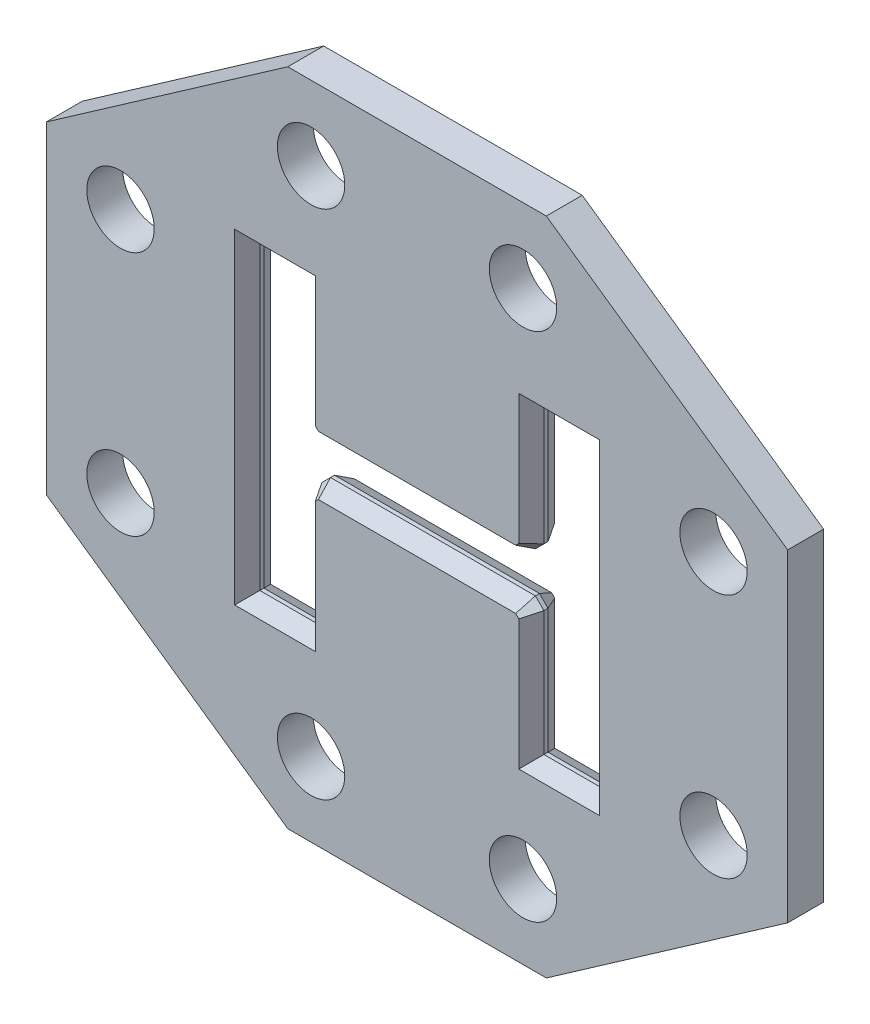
ISO-10303-21;
HEADER;
FILE_DESCRIPTION(('STEP AP214'),'2;1');
FILE_NAME('part.step','',(''),(''),'','','');
FILE_SCHEMA(('AUTOMOTIVE_DESIGN { 1 0 10303 214 1 1 1 1 }'));
ENDSEC;
DATA;
#1=APPLICATION_CONTEXT('core data for automotive mechanical design processes');
#2=APPLICATION_PROTOCOL_DEFINITION('international standard','automotive_design',2000,#1);
#3=PRODUCT_CONTEXT('',#1,'mechanical');
#4=PRODUCT('Part','Part','',(#3));
#5=PRODUCT_RELATED_PRODUCT_CATEGORY('part','',(#4));
#6=PRODUCT_DEFINITION_FORMATION('','',#4);
#7=PRODUCT_DEFINITION_CONTEXT('part definition',#1,'design');
#8=PRODUCT_DEFINITION('design','',#6,#7);
#9=PRODUCT_DEFINITION_SHAPE('','',#8);
#10=(LENGTH_UNIT() NAMED_UNIT(*) SI_UNIT(.MILLI.,.METRE.));
#11=(NAMED_UNIT(*) PLANE_ANGLE_UNIT() SI_UNIT($,.RADIAN.));
#12=(NAMED_UNIT(*) SI_UNIT($,.STERADIAN.) SOLID_ANGLE_UNIT());
#13=UNCERTAINTY_MEASURE_WITH_UNIT(LENGTH_MEASURE(1.E-05),#10,'distance_accuracy_value','');
#14=(GEOMETRIC_REPRESENTATION_CONTEXT(3) GLOBAL_UNCERTAINTY_ASSIGNED_CONTEXT((#13)) GLOBAL_UNIT_ASSIGNED_CONTEXT((#10,
#11,#12)) REPRESENTATION_CONTEXT('',''));
#15=CARTESIAN_POINT('',(0.,0.,0.));
#16=DIRECTION('',(0.,0.,1.));
#17=DIRECTION('',(1.,0.,0.));
#18=AXIS2_PLACEMENT_3D('',#15,#16,#17);
#19=CARTESIAN_POINT('',(156.845,-230.378,25.4));
#20=DIRECTION('',(1.,0.,0.));
#21=DIRECTION('',(0.,0.,-1.));
#22=AXIS2_PLACEMENT_3D('',#19,#20,#21);
#23=PLANE('',#22);
#24=DIRECTION('',(0.,0.,-1.));
#25=VECTOR('',#24,1.);
#26=CARTESIAN_POINT('',(156.845,-216.979499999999,25.4));
#27=LINE('',#26,#25);
#28=CARTESIAN_POINT('',(156.845,-216.979499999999,2.88333950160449));
#29=VERTEX_POINT('',#28);
#30=CARTESIAN_POINT('',(156.845,-216.979499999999,-2.88333950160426));
#31=VERTEX_POINT('',#30);
#32=EDGE_CURVE('E704',#29,#31,#27,.T.);
#33=ORIENTED_EDGE('',*,*,#32,.T.);
#34=DIRECTION('',(0.,1.,0.));
#35=VECTOR('',#34,1.);
#36=CARTESIAN_POINT('',(156.845,-230.378,-2.88333950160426));
#37=LINE('',#36,#35);
#38=CARTESIAN_POINT('',(156.845,-40.8304999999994,-2.88333950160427));
#39=VERTEX_POINT('',#38);
#40=EDGE_CURVE('E58',#31,#39,#37,.T.);
#41=ORIENTED_EDGE('',*,*,#40,.T.);
#42=DIRECTION('',(0.,0.,-1.));
#43=VECTOR('',#42,1.);
#44=CARTESIAN_POINT('',(156.845,-40.8304999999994,25.4));
#45=LINE('',#44,#43);
#46=CARTESIAN_POINT('',(156.845,-40.8304999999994,2.88333950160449));
#47=VERTEX_POINT('',#46);
#48=EDGE_CURVE('E709',#47,#39,#45,.T.);
#49=ORIENTED_EDGE('',*,*,#48,.F.);
#50=DIRECTION('',(0.,-1.,0.));
#51=VECTOR('',#50,1.);
#52=CARTESIAN_POINT('',(156.845,-216.979499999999,2.88333950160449));
#53=LINE('',#52,#51);
#54=EDGE_CURVE('E439',#47,#29,#53,.T.);
#55=ORIENTED_EDGE('',*,*,#54,.T.);
#56=EDGE_LOOP('',(#33,#41,#49,#55));
#57=FACE_BOUND('',#56,.T.);
#58=ADVANCED_FACE('F47',(#57),#23,.T.);
#59=CARTESIAN_POINT('',(-156.845,230.378,25.4));
#60=DIRECTION('',(-1.,0.,0.));
#61=DIRECTION('',(0.,0.,1.));
#62=AXIS2_PLACEMENT_3D('',#59,#60,#61);
#63=PLANE('',#62);
#64=DIRECTION('',(0.,0.,-1.));
#65=VECTOR('',#64,1.);
#66=CARTESIAN_POINT('',(-156.845,216.979500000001,25.4));
#67=LINE('',#66,#65);
#68=CARTESIAN_POINT('',(-156.845,216.979500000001,2.88333950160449));
#69=VERTEX_POINT('',#68);
#70=CARTESIAN_POINT('',(-156.845,216.979500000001,-2.88333950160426));
#71=VERTEX_POINT('',#70);
#72=EDGE_CURVE('E735',#69,#71,#67,.T.);
#73=ORIENTED_EDGE('',*,*,#72,.T.);
#74=DIRECTION('',(0.,-1.,0.));
#75=VECTOR('',#74,1.);
#76=CARTESIAN_POINT('',(-156.845,230.378,-2.88333950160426));
#77=LINE('',#76,#75);
#78=CARTESIAN_POINT('',(-156.845,40.8305000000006,-2.88333950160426));
#79=VERTEX_POINT('',#78);
#80=EDGE_CURVE('E573',#71,#79,#77,.T.);
#81=ORIENTED_EDGE('',*,*,#80,.T.);
#82=DIRECTION('',(0.,0.,-1.));
#83=VECTOR('',#82,1.);
#84=CARTESIAN_POINT('',(-156.845,40.8305000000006,25.4));
#85=LINE('',#84,#83);
#86=CARTESIAN_POINT('',(-156.845,40.8305000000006,2.88333950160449));
#87=VERTEX_POINT('',#86);
#88=EDGE_CURVE('E739',#87,#79,#85,.T.);
#89=ORIENTED_EDGE('',*,*,#88,.F.);
#90=DIRECTION('',(0.,1.,0.));
#91=VECTOR('',#90,1.);
#92=CARTESIAN_POINT('',(-156.845,216.979500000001,2.88333950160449));
#93=LINE('',#92,#91);
#94=EDGE_CURVE('E416',#87,#69,#93,.T.);
#95=ORIENTED_EDGE('',*,*,#94,.T.);
#96=EDGE_LOOP('',(#73,#81,#89,#95));
#97=FACE_BOUND('',#96,.T.);
#98=ADVANCED_FACE('F833',(#97),#63,.T.);
#99=CARTESIAN_POINT('',(0.,0.,25.4));
#100=DIRECTION('',(0.,0.,-1.));
#101=DIRECTION('',(-1.,0.,0.));
#102=AXIS2_PLACEMENT_3D('',#99,#100,#101);
#103=PLANE('',#102);
#104=DIRECTION('',(0.,-1.,0.));
#105=VECTOR('',#104,1.);
#106=CARTESIAN_POINT('',(257.729,-216.979499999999,25.4));
#107=LINE('',#106,#105);
#108=CARTESIAN_POINT('',(257.729,229.979500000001,25.4));
#109=VERTEX_POINT('',#108);
#110=CARTESIAN_POINT('',(257.729,-229.9795,25.4));
#111=VERTEX_POINT('',#110);
#112=EDGE_CURVE('E393',#109,#111,#107,.T.);
#113=ORIENTED_EDGE('',*,*,#112,.T.);
#114=DIRECTION('',(-1.,0.,0.));
#115=VECTOR('',#114,1.);
#116=CARTESIAN_POINT('',(156.845,-229.9795,25.4));
#117=LINE('',#116,#115);
#118=CARTESIAN_POINT('',(143.845,-229.9795,25.4));
#119=VERTEX_POINT('',#118);
#120=EDGE_CURVE('E394',#111,#119,#117,.T.);
#121=ORIENTED_EDGE('',*,*,#120,.T.);
#122=DIRECTION('',(0.,1.,0.));
#123=VECTOR('',#122,1.);
#124=CARTESIAN_POINT('',(143.845,-40.8304999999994,25.4));
#125=LINE('',#124,#123);
#126=CARTESIAN_POINT('',(143.845,-46.2152763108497,25.4));
#127=VERTEX_POINT('',#126);
#128=EDGE_CURVE('E343',#119,#127,#125,.T.);
#129=ORIENTED_EDGE('',*,*,#128,.T.);
#130=DIRECTION('',(-0.707106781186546,0.707106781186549,0.));
#131=VECTOR('',#130,1.);
#132=CARTESIAN_POINT('',(135.587611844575,-37.9578881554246,25.4));
#133=LINE('',#132,#131);
#134=CARTESIAN_POINT('',(139.39522368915,-41.7654999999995,25.4));
#135=VERTEX_POINT('',#134);
#136=EDGE_CURVE('E355',#127,#135,#133,.T.);
#137=ORIENTED_EDGE('',*,*,#136,.T.);
#138=DIRECTION('',(-1.,0.,0.));
#139=VECTOR('',#138,1.);
#140=CARTESIAN_POINT('',(-144.78,-41.7654999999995,25.4));
#141=LINE('',#140,#139);
#142=CARTESIAN_POINT('',(-139.39522368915,-41.7654999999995,25.4));
#143=VERTEX_POINT('',#142);
#144=EDGE_CURVE('E354',#135,#143,#141,.T.);
#145=ORIENTED_EDGE('',*,*,#144,.T.);
#146=DIRECTION('',(-0.707106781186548,-0.707106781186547,0.));
#147=VECTOR('',#146,1.);
#148=CARTESIAN_POINT('',(-147.652611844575,-50.0228881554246,25.4));
#149=LINE('',#148,#147);
#150=CARTESIAN_POINT('',(-143.845,-46.2152763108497,25.4));
#151=VERTEX_POINT('',#150);
#152=EDGE_CURVE('E356',#143,#151,#149,.T.);
#153=ORIENTED_EDGE('',*,*,#152,.T.);
#154=DIRECTION('',(0.,-1.,0.));
#155=VECTOR('',#154,1.);
#156=CARTESIAN_POINT('',(-143.845,-216.979499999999,25.4));
#157=LINE('',#156,#155);
#158=CARTESIAN_POINT('',(-143.845,-229.9795,25.4));
#159=VERTEX_POINT('',#158);
#160=EDGE_CURVE('E363',#151,#159,#157,.T.);
#161=ORIENTED_EDGE('',*,*,#160,.T.);
#162=DIRECTION('',(-1.,0.,0.));
#163=VECTOR('',#162,1.);
#164=CARTESIAN_POINT('',(-244.729,-229.9795,25.4));
#165=LINE('',#164,#163);
#166=CARTESIAN_POINT('',(-257.729,-229.9795,25.4));
#167=VERTEX_POINT('',#166);
#168=EDGE_CURVE('E364',#159,#167,#165,.T.);
#169=ORIENTED_EDGE('',*,*,#168,.T.);
#170=DIRECTION('',(0.,1.,0.));
#171=VECTOR('',#170,1.);
#172=CARTESIAN_POINT('',(-257.729,216.979500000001,25.4));
#173=LINE('',#172,#171);
#174=CARTESIAN_POINT('',(-257.729,229.979500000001,25.4));
#175=VERTEX_POINT('',#174);
#176=EDGE_CURVE('E370',#167,#175,#173,.T.);
#177=ORIENTED_EDGE('',*,*,#176,.T.);
#178=DIRECTION('',(1.,0.,0.));
#179=VECTOR('',#178,1.);
#180=CARTESIAN_POINT('',(-156.845,229.979500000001,25.4));
#181=LINE('',#180,#179);
#182=CARTESIAN_POINT('',(-143.845,229.979500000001,25.4));
#183=VERTEX_POINT('',#182);
#184=EDGE_CURVE('E369',#175,#183,#181,.T.);
#185=ORIENTED_EDGE('',*,*,#184,.T.);
#186=DIRECTION('',(0.,-1.,0.));
#187=VECTOR('',#186,1.);
#188=CARTESIAN_POINT('',(-143.845,40.8305000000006,25.4));
#189=LINE('',#188,#187);
#190=CARTESIAN_POINT('',(-143.845,46.2152763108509,25.4));
#191=VERTEX_POINT('',#190);
#192=EDGE_CURVE('E373',#183,#191,#189,.T.);
#193=ORIENTED_EDGE('',*,*,#192,.T.);
#194=DIRECTION('',(0.707106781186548,-0.707106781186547,0.));
#195=VECTOR('',#194,1.);
#196=CARTESIAN_POINT('',(-135.587611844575,37.9578881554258,25.4));
#197=LINE('',#196,#195);
#198=CARTESIAN_POINT('',(-139.39522368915,41.7655000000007,25.4));
#199=VERTEX_POINT('',#198);
#200=EDGE_CURVE('E376',#191,#199,#197,.T.);
#201=ORIENTED_EDGE('',*,*,#200,.T.);
#202=DIRECTION('',(1.,0.,0.));
#203=VECTOR('',#202,1.);
#204=CARTESIAN_POINT('',(144.78,41.7655000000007,25.4));
#205=LINE('',#204,#203);
#206=CARTESIAN_POINT('',(139.39522368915,41.7655000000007,25.4));
#207=VERTEX_POINT('',#206);
#208=EDGE_CURVE('E378',#199,#207,#205,.T.);
#209=ORIENTED_EDGE('',*,*,#208,.T.);
#210=DIRECTION('',(0.707106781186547,0.707106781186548,0.));
#211=VECTOR('',#210,1.);
#212=CARTESIAN_POINT('',(147.652611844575,50.0228881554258,25.4));
#213=LINE('',#212,#211);
#214=CARTESIAN_POINT('',(143.845,46.2152763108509,25.4));
#215=VERTEX_POINT('',#214);
#216=EDGE_CURVE('E385',#207,#215,#213,.T.);
#217=ORIENTED_EDGE('',*,*,#216,.T.);
#218=DIRECTION('',(0.,1.,0.));
#219=VECTOR('',#218,1.);
#220=CARTESIAN_POINT('',(143.845,216.979500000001,25.4));
#221=LINE('',#220,#219);
#222=CARTESIAN_POINT('',(143.845,229.979500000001,25.4));
#223=VERTEX_POINT('',#222);
#224=EDGE_CURVE('E383',#215,#223,#221,.T.);
#225=ORIENTED_EDGE('',*,*,#224,.T.);
#226=DIRECTION('',(1.,0.,0.));
#227=VECTOR('',#226,1.);
#228=CARTESIAN_POINT('',(244.729,229.979500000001,25.4));
#229=LINE('',#228,#227);
#230=EDGE_CURVE('E389',#223,#109,#229,.T.);
#231=ORIENTED_EDGE('',*,*,#230,.T.);
#232=EDGE_LOOP('',(#113,#121,#129,#137,#145,#153,#161,#169,#177,#185,#193,#201,#209,#217,#225,#231));
#233=FACE_BOUND('',#232,.T.);
#234=CARTESIAN_POINT('',(-149.758610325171,-361.549268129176,25.4));
#235=DIRECTION('',(0.,0.,1.));
#236=DIRECTION('',(1.,0.,0.));
#237=AXIS2_PLACEMENT_3D('',#234,#235,#236);
#238=CIRCLE('',#237,47.625);
#239=CARTESIAN_POINT('',(-102.133610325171,-361.549268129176,25.4));
#240=VERTEX_POINT('',#239);
#241=EDGE_CURVE('E1667',#240,#240,#238,.T.);
#242=ORIENTED_EDGE('',*,*,#241,.F.);
#243=EDGE_LOOP('',(#242));
#244=FACE_BOUND('',#243,.T.);
#245=CARTESIAN_POINT('',(149.758610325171,-361.549268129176,25.4));
#246=DIRECTION('',(0.,0.,1.));
#247=DIRECTION('',(1.,0.,0.));
#248=AXIS2_PLACEMENT_3D('',#245,#246,#247);
#249=CIRCLE('',#248,47.625);
#250=CARTESIAN_POINT('',(197.383610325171,-361.549268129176,25.4));
#251=VERTEX_POINT('',#250);
#252=EDGE_CURVE('E1673',#251,#251,#249,.T.);
#253=ORIENTED_EDGE('',*,*,#252,.F.);
#254=EDGE_LOOP('',(#253));
#255=FACE_BOUND('',#254,.T.);
#256=CARTESIAN_POINT('',(419.080268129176,-173.588730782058,25.4));
#257=DIRECTION('',(0.,0.,1.));
#258=DIRECTION('',(1.,0.,0.));
#259=AXIS2_PLACEMENT_3D('',#256,#257,#258);
#260=CIRCLE('',#259,47.625);
#261=CARTESIAN_POINT('',(466.705268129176,-173.588730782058,25.4));
#262=VERTEX_POINT('',#261);
#263=EDGE_CURVE('E1680',#262,#262,#260,.T.);
#264=ORIENTED_EDGE('',*,*,#263,.F.);
#265=EDGE_LOOP('',(#264));
#266=FACE_BOUND('',#265,.T.);
#267=CARTESIAN_POINT('',(419.080268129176,173.588730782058,25.4));
#268=DIRECTION('',(0.,0.,1.));
#269=DIRECTION('',(1.,0.,0.));
#270=AXIS2_PLACEMENT_3D('',#267,#268,#269);
#271=CIRCLE('',#270,47.625);
#272=CARTESIAN_POINT('',(466.705268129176,173.588730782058,25.4));
#273=VERTEX_POINT('',#272);
#274=EDGE_CURVE('E1682',#273,#273,#271,.T.);
#275=ORIENTED_EDGE('',*,*,#274,.F.);
#276=EDGE_LOOP('',(#275));
#277=FACE_BOUND('',#276,.T.);
#278=CARTESIAN_POINT('',(149.758610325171,361.549268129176,25.4));
#279=DIRECTION('',(0.,0.,1.));
#280=DIRECTION('',(1.,0.,0.));
#281=AXIS2_PLACEMENT_3D('',#278,#279,#280);
#282=CIRCLE('',#281,47.625);
#283=CARTESIAN_POINT('',(197.383610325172,361.549268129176,25.4));
#284=VERTEX_POINT('',#283);
#285=EDGE_CURVE('E1683',#284,#284,#282,.T.);
#286=ORIENTED_EDGE('',*,*,#285,.F.);
#287=EDGE_LOOP('',(#286));
#288=FACE_BOUND('',#287,.T.);
#289=CARTESIAN_POINT('',(-149.758610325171,361.549268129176,25.4));
#290=DIRECTION('',(0.,0.,1.));
#291=DIRECTION('',(1.,0.,0.));
#292=AXIS2_PLACEMENT_3D('',#289,#290,#291);
#293=CIRCLE('',#292,47.625);
#294=CARTESIAN_POINT('',(-102.133610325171,361.549268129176,25.4));
#295=VERTEX_POINT('',#294);
#296=EDGE_CURVE('E1688',#295,#295,#293,.T.);
#297=ORIENTED_EDGE('',*,*,#296,.F.);
#298=EDGE_LOOP('',(#297));
#299=FACE_BOUND('',#298,.T.);
#300=CARTESIAN_POINT('',(-419.080268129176,173.588730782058,25.4));
#301=DIRECTION('',(0.,0.,1.));
#302=DIRECTION('',(1.,0.,0.));
#303=AXIS2_PLACEMENT_3D('',#300,#301,#302);
#304=CIRCLE('',#303,47.625);
#305=CARTESIAN_POINT('',(-371.455268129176,173.588730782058,25.4));
#306=VERTEX_POINT('',#305);
#307=EDGE_CURVE('E1691',#306,#306,#304,.T.);
#308=ORIENTED_EDGE('',*,*,#307,.F.);
#309=EDGE_LOOP('',(#308));
#310=FACE_BOUND('',#309,.T.);
#311=CARTESIAN_POINT('',(-419.080268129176,-173.588730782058,25.4));
#312=DIRECTION('',(0.,0.,1.));
#313=DIRECTION('',(1.,0.,0.));
#314=AXIS2_PLACEMENT_3D('',#311,#312,#313);
#315=CIRCLE('',#314,47.625);
#316=CARTESIAN_POINT('',(-371.455268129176,-173.588730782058,25.4));
#317=VERTEX_POINT('',#316);
#318=EDGE_CURVE('E1696',#317,#317,#315,.T.);
#319=ORIENTED_EDGE('',*,*,#318,.F.);
#320=EDGE_LOOP('',(#319));
#321=FACE_BOUND('',#320,.T.);
#322=DIRECTION('',(0.,-1.,0.));
#323=VECTOR('',#322,1.);
#324=CARTESIAN_POINT('',(-523.855268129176,-228.234235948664,25.4));
#325=LINE('',#324,#323);
#326=CARTESIAN_POINT('',(-523.855268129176,228.234235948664,25.4));
#327=VERTEX_POINT('',#326);
#328=CARTESIAN_POINT('',(-523.855268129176,-228.234235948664,25.4));
#329=VERTEX_POINT('',#328);
#330=EDGE_CURVE('E324',#327,#329,#325,.T.);
#331=ORIENTED_EDGE('',*,*,#330,.T.);
#332=DIRECTION('',(0.820038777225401,-0.572307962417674,0.));
#333=VECTOR('',#332,1.);
#334=CARTESIAN_POINT('',(-182.70492307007,-466.324268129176,25.4));
#335=LINE('',#334,#333);
#336=CARTESIAN_POINT('',(-182.70492307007,-466.324268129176,25.4));
#337=VERTEX_POINT('',#336);
#338=EDGE_CURVE('E311',#329,#337,#335,.T.);
#339=ORIENTED_EDGE('',*,*,#338,.T.);
#340=DIRECTION('',(1.,0.,0.));
#341=VECTOR('',#340,1.);
#342=CARTESIAN_POINT('',(182.70492307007,-466.324268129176,25.4));
#343=LINE('',#342,#341);
#344=CARTESIAN_POINT('',(182.70492307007,-466.324268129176,25.4));
#345=VERTEX_POINT('',#344);
#346=EDGE_CURVE('E322',#337,#345,#343,.T.);
#347=ORIENTED_EDGE('',*,*,#346,.T.);
#348=DIRECTION('',(0.820038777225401,0.572307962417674,0.));
#349=VECTOR('',#348,1.);
#350=CARTESIAN_POINT('',(523.855268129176,-228.234235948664,25.4));
#351=LINE('',#350,#349);
#352=CARTESIAN_POINT('',(523.855268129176,-228.234235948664,25.4));
#353=VERTEX_POINT('',#352);
#354=EDGE_CURVE('E744',#345,#353,#351,.T.);
#355=ORIENTED_EDGE('',*,*,#354,.T.);
#356=DIRECTION('',(0.,1.,0.));
#357=VECTOR('',#356,1.);
#358=CARTESIAN_POINT('',(523.855268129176,228.234235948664,25.4));
#359=LINE('',#358,#357);
#360=CARTESIAN_POINT('',(523.855268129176,228.234235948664,25.4));
#361=VERTEX_POINT('',#360);
#362=EDGE_CURVE('E746',#353,#361,#359,.T.);
#363=ORIENTED_EDGE('',*,*,#362,.T.);
#364=DIRECTION('',(-0.820038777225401,0.572307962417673,0.));
#365=VECTOR('',#364,1.);
#366=CARTESIAN_POINT('',(182.70492307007,466.324268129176,25.4));
#367=LINE('',#366,#365);
#368=CARTESIAN_POINT('',(182.70492307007,466.324268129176,25.4));
#369=VERTEX_POINT('',#368);
#370=EDGE_CURVE('E753',#361,#369,#367,.T.);
#371=ORIENTED_EDGE('',*,*,#370,.T.);
#372=DIRECTION('',(-1.,0.,0.));
#373=VECTOR('',#372,1.);
#374=CARTESIAN_POINT('',(-182.704923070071,466.324268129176,25.4));
#375=LINE('',#374,#373);
#376=CARTESIAN_POINT('',(-182.704923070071,466.324268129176,25.4));
#377=VERTEX_POINT('',#376);
#378=EDGE_CURVE('E754',#369,#377,#375,.T.);
#379=ORIENTED_EDGE('',*,*,#378,.T.);
#380=DIRECTION('',(-0.8200387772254,-0.572307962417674,0.));
#381=VECTOR('',#380,1.);
#382=CARTESIAN_POINT('',(-523.855268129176,228.234235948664,25.4));
#383=LINE('',#382,#381);
#384=EDGE_CURVE('E326',#377,#327,#383,.T.);
#385=ORIENTED_EDGE('',*,*,#384,.T.);
#386=EDGE_LOOP('',(#331,#339,#347,#355,#363,#371,#379,#385));
#387=FACE_BOUND('',#386,.T.);
#388=ADVANCED_FACE('F328',(#233,#244,#255,#266,#277,#288,#299,#310,#321,#387),#103,.F.);
#389=CARTESIAN_POINT('',(0.,0.,-25.4));
#390=DIRECTION('',(0.,0.,-1.));
#391=DIRECTION('',(-1.,0.,0.));
#392=AXIS2_PLACEMENT_3D('',#389,#390,#391);
#393=PLANE('',#392);
#394=DIRECTION('',(0.707106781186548,0.707106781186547,0.));
#395=VECTOR('',#394,1.);
#396=CARTESIAN_POINT('',(-48.8148618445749,48.814861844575,-25.4));
#397=LINE('',#396,#395);
#398=CARTESIAN_POINT('',(-143.845,-46.2152763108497,-25.4));
#399=VERTEX_POINT('',#398);
#400=CARTESIAN_POINT('',(-139.39522368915,-41.7654999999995,-25.4));
#401=VERTEX_POINT('',#400);
#402=EDGE_CURVE('E548',#399,#401,#397,.T.);
#403=ORIENTED_EDGE('',*,*,#402,.T.);
#404=DIRECTION('',(1.,0.,0.));
#405=VECTOR('',#404,1.);
#406=CARTESIAN_POINT('',(0.,-41.7654999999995,-25.4));
#407=LINE('',#406,#405);
#408=CARTESIAN_POINT('',(139.39522368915,-41.7654999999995,-25.4));
#409=VERTEX_POINT('',#408);
#410=EDGE_CURVE('E553',#401,#409,#407,.T.);
#411=ORIENTED_EDGE('',*,*,#410,.T.);
#412=DIRECTION('',(0.707106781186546,-0.707106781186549,0.));
#413=VECTOR('',#412,1.);
#414=CARTESIAN_POINT('',(48.8148618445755,48.8148618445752,-25.4));
#415=LINE('',#414,#413);
#416=CARTESIAN_POINT('',(143.845,-46.2152763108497,-25.4));
#417=VERTEX_POINT('',#416);
#418=EDGE_CURVE('E442',#409,#417,#415,.T.);
#419=ORIENTED_EDGE('',*,*,#418,.T.);
#420=DIRECTION('',(0.,-1.,0.));
#421=VECTOR('',#420,1.);
#422=CARTESIAN_POINT('',(143.845,0.,-25.4));
#423=LINE('',#422,#421);
#424=CARTESIAN_POINT('',(143.845,-229.9795,-25.4));
#425=VERTEX_POINT('',#424);
#426=EDGE_CURVE('E508',#417,#425,#423,.T.);
#427=ORIENTED_EDGE('',*,*,#426,.T.);
#428=DIRECTION('',(1.,0.,0.));
#429=VECTOR('',#428,1.);
#430=CARTESIAN_POINT('',(0.,-229.979499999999,-25.4));
#431=LINE('',#430,#429);
#432=CARTESIAN_POINT('',(257.729,-229.9795,-25.4));
#433=VERTEX_POINT('',#432);
#434=EDGE_CURVE('E515',#425,#433,#431,.T.);
#435=ORIENTED_EDGE('',*,*,#434,.T.);
#436=DIRECTION('',(0.,1.,0.));
#437=VECTOR('',#436,1.);
#438=CARTESIAN_POINT('',(257.729,0.,-25.4));
#439=LINE('',#438,#437);
#440=CARTESIAN_POINT('',(257.729,229.979500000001,-25.4));
#441=VERTEX_POINT('',#440);
#442=EDGE_CURVE('E513',#433,#441,#439,.T.);
#443=ORIENTED_EDGE('',*,*,#442,.T.);
#444=DIRECTION('',(-1.,0.,0.));
#445=VECTOR('',#444,1.);
#446=CARTESIAN_POINT('',(0.,229.979500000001,-25.4));
#447=LINE('',#446,#445);
#448=CARTESIAN_POINT('',(143.845,229.979500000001,-25.4));
#449=VERTEX_POINT('',#448);
#450=EDGE_CURVE('E519',#441,#449,#447,.T.);
#451=ORIENTED_EDGE('',*,*,#450,.T.);
#452=DIRECTION('',(0.,-1.,0.));
#453=VECTOR('',#452,1.);
#454=CARTESIAN_POINT('',(143.845,0.,-25.4));
#455=LINE('',#454,#453);
#456=CARTESIAN_POINT('',(143.845,46.2152763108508,-25.4));
#457=VERTEX_POINT('',#456);
#458=EDGE_CURVE('E523',#449,#457,#455,.T.);
#459=ORIENTED_EDGE('',*,*,#458,.T.);
#460=DIRECTION('',(-0.707106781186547,-0.707106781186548,0.));
#461=VECTOR('',#460,1.);
#462=CARTESIAN_POINT('',(48.8148618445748,-48.8148618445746,-25.4));
#463=LINE('',#462,#461);
#464=CARTESIAN_POINT('',(139.39522368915,41.7655000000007,-25.4));
#465=VERTEX_POINT('',#464);
#466=EDGE_CURVE('E524',#457,#465,#463,.T.);
#467=ORIENTED_EDGE('',*,*,#466,.T.);
#468=DIRECTION('',(-1.,0.,0.));
#469=VECTOR('',#468,1.);
#470=CARTESIAN_POINT('',(0.,41.7655000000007,-25.4));
#471=LINE('',#470,#469);
#472=CARTESIAN_POINT('',(-139.39522368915,41.7655000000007,-25.4));
#473=VERTEX_POINT('',#472);
#474=EDGE_CURVE('E530',#465,#473,#471,.T.);
#475=ORIENTED_EDGE('',*,*,#474,.T.);
#476=DIRECTION('',(-0.707106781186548,0.707106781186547,0.));
#477=VECTOR('',#476,1.);
#478=CARTESIAN_POINT('',(-48.8148618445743,-48.8148618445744,-25.4));
#479=LINE('',#478,#477);
#480=CARTESIAN_POINT('',(-143.845,46.2152763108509,-25.4));
#481=VERTEX_POINT('',#480);
#482=EDGE_CURVE('E529',#473,#481,#479,.T.);
#483=ORIENTED_EDGE('',*,*,#482,.T.);
#484=DIRECTION('',(0.,1.,0.));
#485=VECTOR('',#484,1.);
#486=CARTESIAN_POINT('',(-143.845,0.,-25.4));
#487=LINE('',#486,#485);
#488=CARTESIAN_POINT('',(-143.845,229.979500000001,-25.4));
#489=VERTEX_POINT('',#488);
#490=EDGE_CURVE('E531',#481,#489,#487,.T.);
#491=ORIENTED_EDGE('',*,*,#490,.T.);
#492=DIRECTION('',(-1.,0.,0.));
#493=VECTOR('',#492,1.);
#494=CARTESIAN_POINT('',(1.45264516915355E-13,229.979500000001,-25.4));
#495=LINE('',#494,#493);
#496=CARTESIAN_POINT('',(-257.729,229.979500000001,-25.4));
#497=VERTEX_POINT('',#496);
#498=EDGE_CURVE('E536',#489,#497,#495,.T.);
#499=ORIENTED_EDGE('',*,*,#498,.T.);
#500=DIRECTION('',(0.,-1.,0.));
#501=VECTOR('',#500,1.);
#502=CARTESIAN_POINT('',(-257.729,0.,-25.4));
#503=LINE('',#502,#501);
#504=CARTESIAN_POINT('',(-257.729,-229.9795,-25.4));
#505=VERTEX_POINT('',#504);
#506=EDGE_CURVE('E538',#497,#505,#503,.T.);
#507=ORIENTED_EDGE('',*,*,#506,.T.);
#508=DIRECTION('',(1.,0.,0.));
#509=VECTOR('',#508,1.);
#510=CARTESIAN_POINT('',(0.,-229.9795,-25.4));
#511=LINE('',#510,#509);
#512=CARTESIAN_POINT('',(-143.845,-229.9795,-25.4));
#513=VERTEX_POINT('',#512);
#514=EDGE_CURVE('E545',#505,#513,#511,.T.);
#515=ORIENTED_EDGE('',*,*,#514,.T.);
#516=DIRECTION('',(0.,1.,0.));
#517=VECTOR('',#516,1.);
#518=CARTESIAN_POINT('',(-143.845,0.,-25.4));
#519=LINE('',#518,#517);
#520=EDGE_CURVE('E542',#513,#399,#519,.T.);
#521=ORIENTED_EDGE('',*,*,#520,.T.);
#522=EDGE_LOOP('',(#403,#411,#419,#427,#435,#443,#451,#459,#467,#475,#483,#491,#499,#507,#515,#521));
#523=FACE_BOUND('',#522,.T.);
#524=CARTESIAN_POINT('',(-149.758610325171,-361.549268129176,-25.4));
#525=DIRECTION('',(0.,0.,1.));
#526=DIRECTION('',(1.,0.,0.));
#527=AXIS2_PLACEMENT_3D('',#524,#525,#526);
#528=CIRCLE('',#527,47.625);
#529=CARTESIAN_POINT('',(-102.133610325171,-361.549268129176,-25.4));
#530=VERTEX_POINT('',#529);
#531=EDGE_CURVE('E506',#530,#530,#528,.T.);
#532=ORIENTED_EDGE('',*,*,#531,.T.);
#533=EDGE_LOOP('',(#532));
#534=FACE_BOUND('',#533,.T.);
#535=CARTESIAN_POINT('',(149.758610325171,-361.549268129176,-25.4));
#536=DIRECTION('',(0.,0.,1.));
#537=DIRECTION('',(1.,0.,0.));
#538=AXIS2_PLACEMENT_3D('',#535,#536,#537);
#539=CIRCLE('',#538,47.625);
#540=CARTESIAN_POINT('',(197.383610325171,-361.549268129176,-25.4));
#541=VERTEX_POINT('',#540);
#542=EDGE_CURVE('E1709',#541,#541,#539,.T.);
#543=ORIENTED_EDGE('',*,*,#542,.T.);
#544=EDGE_LOOP('',(#543));
#545=FACE_BOUND('',#544,.T.);
#546=CARTESIAN_POINT('',(419.080268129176,-173.588730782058,-25.4));
#547=DIRECTION('',(0.,0.,1.));
#548=DIRECTION('',(1.,0.,0.));
#549=AXIS2_PLACEMENT_3D('',#546,#547,#548);
#550=CIRCLE('',#549,47.625);
#551=CARTESIAN_POINT('',(466.705268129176,-173.588730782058,-25.4));
#552=VERTEX_POINT('',#551);
#553=EDGE_CURVE('E1714',#552,#552,#550,.T.);
#554=ORIENTED_EDGE('',*,*,#553,.T.);
#555=EDGE_LOOP('',(#554));
#556=FACE_BOUND('',#555,.T.);
#557=CARTESIAN_POINT('',(419.080268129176,173.588730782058,-25.4));
#558=DIRECTION('',(0.,0.,1.));
#559=DIRECTION('',(1.,0.,0.));
#560=AXIS2_PLACEMENT_3D('',#557,#558,#559);
#561=CIRCLE('',#560,47.625);
#562=CARTESIAN_POINT('',(466.705268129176,173.588730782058,-25.4));
#563=VERTEX_POINT('',#562);
#564=EDGE_CURVE('E1719',#563,#563,#561,.T.);
#565=ORIENTED_EDGE('',*,*,#564,.T.);
#566=EDGE_LOOP('',(#565));
#567=FACE_BOUND('',#566,.T.);
#568=CARTESIAN_POINT('',(149.758610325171,361.549268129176,-25.4));
#569=DIRECTION('',(0.,0.,1.));
#570=DIRECTION('',(1.,0.,0.));
#571=AXIS2_PLACEMENT_3D('',#568,#569,#570);
#572=CIRCLE('',#571,47.625);
#573=CARTESIAN_POINT('',(197.383610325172,361.549268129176,-25.4));
#574=VERTEX_POINT('',#573);
#575=EDGE_CURVE('E1728',#574,#574,#572,.T.);
#576=ORIENTED_EDGE('',*,*,#575,.T.);
#577=EDGE_LOOP('',(#576));
#578=FACE_BOUND('',#577,.T.);
#579=CARTESIAN_POINT('',(-149.758610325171,361.549268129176,-25.4));
#580=DIRECTION('',(0.,0.,1.));
#581=DIRECTION('',(1.,0.,0.));
#582=AXIS2_PLACEMENT_3D('',#579,#580,#581);
#583=CIRCLE('',#582,47.625);
#584=CARTESIAN_POINT('',(-102.133610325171,361.549268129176,-25.4));
#585=VERTEX_POINT('',#584);
#586=EDGE_CURVE('E1735',#585,#585,#583,.T.);
#587=ORIENTED_EDGE('',*,*,#586,.T.);
#588=EDGE_LOOP('',(#587));
#589=FACE_BOUND('',#588,.T.);
#590=CARTESIAN_POINT('',(-419.080268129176,173.588730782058,-25.4));
#591=DIRECTION('',(0.,0.,1.));
#592=DIRECTION('',(1.,0.,0.));
#593=AXIS2_PLACEMENT_3D('',#590,#591,#592);
#594=CIRCLE('',#593,47.625);
#595=CARTESIAN_POINT('',(-371.455268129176,173.588730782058,-25.4));
#596=VERTEX_POINT('',#595);
#597=EDGE_CURVE('E1701',#596,#596,#594,.T.);
#598=ORIENTED_EDGE('',*,*,#597,.T.);
#599=EDGE_LOOP('',(#598));
#600=FACE_BOUND('',#599,.T.);
#601=CARTESIAN_POINT('',(-419.080268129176,-173.588730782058,-25.4));
#602=DIRECTION('',(0.,0.,1.));
#603=DIRECTION('',(1.,0.,0.));
#604=AXIS2_PLACEMENT_3D('',#601,#602,#603);
#605=CIRCLE('',#604,47.625);
#606=CARTESIAN_POINT('',(-371.455268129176,-173.588730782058,-25.4));
#607=VERTEX_POINT('',#606);
#608=EDGE_CURVE('E691',#607,#607,#605,.T.);
#609=ORIENTED_EDGE('',*,*,#608,.T.);
#610=EDGE_LOOP('',(#609));
#611=FACE_BOUND('',#610,.T.);
#612=DIRECTION('',(0.,-1.,0.));
#613=VECTOR('',#612,1.);
#614=CARTESIAN_POINT('',(-523.855268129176,-228.234235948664,-25.4));
#615=LINE('',#614,#613);
#616=CARTESIAN_POINT('',(-523.855268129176,228.234235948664,-25.4));
#617=VERTEX_POINT('',#616);
#618=CARTESIAN_POINT('',(-523.855268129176,-228.234235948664,-25.4));
#619=VERTEX_POINT('',#618);
#620=EDGE_CURVE('E340',#617,#619,#615,.T.);
#621=ORIENTED_EDGE('',*,*,#620,.F.);
#622=DIRECTION('',(-0.8200387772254,-0.572307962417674,0.));
#623=VECTOR('',#622,1.);
#624=CARTESIAN_POINT('',(-523.855268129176,228.234235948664,-25.4));
#625=LINE('',#624,#623);
#626=CARTESIAN_POINT('',(-182.704923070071,466.324268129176,-25.4));
#627=VERTEX_POINT('',#626);
#628=EDGE_CURVE('E333',#627,#617,#625,.T.);
#629=ORIENTED_EDGE('',*,*,#628,.F.);
#630=DIRECTION('',(-1.,0.,0.));
#631=VECTOR('',#630,1.);
#632=CARTESIAN_POINT('',(-182.704923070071,466.324268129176,-25.4));
#633=LINE('',#632,#631);
#634=CARTESIAN_POINT('',(182.70492307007,466.324268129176,-25.4));
#635=VERTEX_POINT('',#634);
#636=EDGE_CURVE('E777',#635,#627,#633,.T.);
#637=ORIENTED_EDGE('',*,*,#636,.F.);
#638=DIRECTION('',(-0.820038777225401,0.572307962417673,0.));
#639=VECTOR('',#638,1.);
#640=CARTESIAN_POINT('',(182.70492307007,466.324268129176,-25.4));
#641=LINE('',#640,#639);
#642=CARTESIAN_POINT('',(523.855268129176,228.234235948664,-25.4));
#643=VERTEX_POINT('',#642);
#644=EDGE_CURVE('E771',#643,#635,#641,.T.);
#645=ORIENTED_EDGE('',*,*,#644,.F.);
#646=DIRECTION('',(0.,1.,0.));
#647=VECTOR('',#646,1.);
#648=CARTESIAN_POINT('',(523.855268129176,228.234235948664,-25.4));
#649=LINE('',#648,#647);
#650=CARTESIAN_POINT('',(523.855268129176,-228.234235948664,-25.4));
#651=VERTEX_POINT('',#650);
#652=EDGE_CURVE('E772',#651,#643,#649,.T.);
#653=ORIENTED_EDGE('',*,*,#652,.F.);
#654=DIRECTION('',(0.820038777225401,0.572307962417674,0.));
#655=VECTOR('',#654,1.);
#656=CARTESIAN_POINT('',(523.855268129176,-228.234235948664,-25.4));
#657=LINE('',#656,#655);
#658=CARTESIAN_POINT('',(182.70492307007,-466.324268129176,-25.4));
#659=VERTEX_POINT('',#658);
#660=EDGE_CURVE('E767',#659,#651,#657,.T.);
#661=ORIENTED_EDGE('',*,*,#660,.F.);
#662=DIRECTION('',(1.,0.,0.));
#663=VECTOR('',#662,1.);
#664=CARTESIAN_POINT('',(182.70492307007,-466.324268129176,-25.4));
#665=LINE('',#664,#663);
#666=CARTESIAN_POINT('',(-182.70492307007,-466.324268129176,-25.4));
#667=VERTEX_POINT('',#666);
#668=EDGE_CURVE('E764',#667,#659,#665,.T.);
#669=ORIENTED_EDGE('',*,*,#668,.F.);
#670=DIRECTION('',(0.820038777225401,-0.572307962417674,0.));
#671=VECTOR('',#670,1.);
#672=CARTESIAN_POINT('',(-182.70492307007,-466.324268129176,-25.4));
#673=LINE('',#672,#671);
#674=EDGE_CURVE('E765',#619,#667,#673,.T.);
#675=ORIENTED_EDGE('',*,*,#674,.F.);
#676=EDGE_LOOP('',(#621,#629,#637,#645,#653,#661,#669,#675));
#677=FACE_BOUND('',#676,.T.);
#678=ADVANCED_FACE('F813',(#523,#534,#545,#556,#567,#578,#589,#600,#611,#677),#393,.T.);
#679=CARTESIAN_POINT('',(-523.855268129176,-228.234235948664,25.4));
#680=DIRECTION('',(1.,0.,0.));
#681=DIRECTION('',(0.,0.,-1.));
#682=AXIS2_PLACEMENT_3D('',#679,#680,#681);
#683=PLANE('',#682);
#684=ORIENTED_EDGE('',*,*,#620,.T.);
#685=DIRECTION('',(0.,0.,-1.));
#686=VECTOR('',#685,1.);
#687=CARTESIAN_POINT('',(-523.855268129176,-228.234235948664,25.4));
#688=LINE('',#687,#686);
#689=EDGE_CURVE('E314',#329,#619,#688,.T.);
#690=ORIENTED_EDGE('',*,*,#689,.F.);
#691=ORIENTED_EDGE('',*,*,#330,.F.);
#692=DIRECTION('',(0.,0.,-1.));
#693=VECTOR('',#692,1.);
#694=CARTESIAN_POINT('',(-523.855268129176,228.234235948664,25.4));
#695=LINE('',#694,#693);
#696=EDGE_CURVE('E757',#327,#617,#695,.T.);
#697=ORIENTED_EDGE('',*,*,#696,.T.);
#698=EDGE_LOOP('',(#684,#690,#691,#697));
#699=FACE_BOUND('',#698,.T.);
#700=ADVANCED_FACE('F334',(#699),#683,.F.);
#701=CARTESIAN_POINT('',(-182.70492307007,-466.324268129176,25.4));
#702=DIRECTION('',(0.572307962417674,0.820038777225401,0.));
#703=DIRECTION('',(-0.820038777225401,0.572307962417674,0.));
#704=AXIS2_PLACEMENT_3D('',#701,#702,#703);
#705=PLANE('',#704);
#706=ORIENTED_EDGE('',*,*,#674,.T.);
#707=DIRECTION('',(0.,0.,-1.));
#708=VECTOR('',#707,1.);
#709=CARTESIAN_POINT('',(-182.70492307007,-466.324268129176,25.4));
#710=LINE('',#709,#708);
#711=EDGE_CURVE('E319',#337,#667,#710,.T.);
#712=ORIENTED_EDGE('',*,*,#711,.F.);
#713=ORIENTED_EDGE('',*,*,#338,.F.);
#714=ORIENTED_EDGE('',*,*,#689,.T.);
#715=EDGE_LOOP('',(#706,#712,#713,#714));
#716=FACE_BOUND('',#715,.T.);
#717=ADVANCED_FACE('F312',(#716),#705,.F.);
#718=CARTESIAN_POINT('',(182.70492307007,-466.324268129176,25.4));
#719=DIRECTION('',(0.,1.,0.));
#720=DIRECTION('',(0.,0.,1.));
#721=AXIS2_PLACEMENT_3D('',#718,#719,#720);
#722=PLANE('',#721);
#723=ORIENTED_EDGE('',*,*,#668,.T.);
#724=DIRECTION('',(0.,0.,-1.));
#725=VECTOR('',#724,1.);
#726=CARTESIAN_POINT('',(182.70492307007,-466.324268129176,25.4));
#727=LINE('',#726,#725);
#728=EDGE_CURVE('E348',#345,#659,#727,.T.);
#729=ORIENTED_EDGE('',*,*,#728,.F.);
#730=ORIENTED_EDGE('',*,*,#346,.F.);
#731=ORIENTED_EDGE('',*,*,#711,.T.);
#732=EDGE_LOOP('',(#723,#729,#730,#731));
#733=FACE_BOUND('',#732,.T.);
#734=ADVANCED_FACE('F822',(#733),#722,.F.);
#735=CARTESIAN_POINT('',(523.855268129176,-228.234235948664,25.4));
#736=DIRECTION('',(-0.572307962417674,0.820038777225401,0.));
#737=DIRECTION('',(-0.820038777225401,-0.572307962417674,0.));
#738=AXIS2_PLACEMENT_3D('',#735,#736,#737);
#739=PLANE('',#738);
#740=ORIENTED_EDGE('',*,*,#660,.T.);
#741=DIRECTION('',(0.,0.,-1.));
#742=VECTOR('',#741,1.);
#743=CARTESIAN_POINT('',(523.855268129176,-228.234235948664,25.4));
#744=LINE('',#743,#742);
#745=EDGE_CURVE('E796',#353,#651,#744,.T.);
#746=ORIENTED_EDGE('',*,*,#745,.F.);
#747=ORIENTED_EDGE('',*,*,#354,.F.);
#748=ORIENTED_EDGE('',*,*,#728,.T.);
#749=EDGE_LOOP('',(#740,#746,#747,#748));
#750=FACE_BOUND('',#749,.T.);
#751=ADVANCED_FACE('F802',(#750),#739,.F.);
#752=CARTESIAN_POINT('',(523.855268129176,228.234235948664,25.4));
#753=DIRECTION('',(-1.,0.,0.));
#754=DIRECTION('',(0.,-1.,0.));
#755=AXIS2_PLACEMENT_3D('',#752,#753,#754);
#756=PLANE('',#755);
#757=ORIENTED_EDGE('',*,*,#652,.T.);
#758=DIRECTION('',(0.,0.,-1.));
#759=VECTOR('',#758,1.);
#760=CARTESIAN_POINT('',(523.855268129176,228.234235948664,25.4));
#761=LINE('',#760,#759);
#762=EDGE_CURVE('E795',#361,#643,#761,.T.);
#763=ORIENTED_EDGE('',*,*,#762,.F.);
#764=ORIENTED_EDGE('',*,*,#362,.F.);
#765=ORIENTED_EDGE('',*,*,#745,.T.);
#766=EDGE_LOOP('',(#757,#763,#764,#765));
#767=FACE_BOUND('',#766,.T.);
#768=ADVANCED_FACE('F818',(#767),#756,.F.);
#769=CARTESIAN_POINT('',(182.70492307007,466.324268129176,25.4));
#770=DIRECTION('',(-0.572307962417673,-0.820038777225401,0.));
#771=DIRECTION('',(0.820038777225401,-0.572307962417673,0.));
#772=AXIS2_PLACEMENT_3D('',#769,#770,#771);
#773=PLANE('',#772);
#774=ORIENTED_EDGE('',*,*,#644,.T.);
#775=DIRECTION('',(0.,0.,-1.));
#776=VECTOR('',#775,1.);
#777=CARTESIAN_POINT('',(182.70492307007,466.324268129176,25.4));
#778=LINE('',#777,#776);
#779=EDGE_CURVE('E788',#369,#635,#778,.T.);
#780=ORIENTED_EDGE('',*,*,#779,.F.);
#781=ORIENTED_EDGE('',*,*,#370,.F.);
#782=ORIENTED_EDGE('',*,*,#762,.T.);
#783=EDGE_LOOP('',(#774,#780,#781,#782));
#784=FACE_BOUND('',#783,.T.);
#785=ADVANCED_FACE('F817',(#784),#773,.F.);
#786=CARTESIAN_POINT('',(-182.704923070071,466.324268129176,25.4));
#787=DIRECTION('',(0.,-1.,0.));
#788=DIRECTION('',(1.,0.,0.));
#789=AXIS2_PLACEMENT_3D('',#786,#787,#788);
#790=PLANE('',#789);
#791=ORIENTED_EDGE('',*,*,#636,.T.);
#792=DIRECTION('',(0.,0.,-1.));
#793=VECTOR('',#792,1.);
#794=CARTESIAN_POINT('',(-182.704923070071,466.324268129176,25.4));
#795=LINE('',#794,#793);
#796=EDGE_CURVE('E784',#377,#627,#795,.T.);
#797=ORIENTED_EDGE('',*,*,#796,.F.);
#798=ORIENTED_EDGE('',*,*,#378,.F.);
#799=ORIENTED_EDGE('',*,*,#779,.T.);
#800=EDGE_LOOP('',(#791,#797,#798,#799));
#801=FACE_BOUND('',#800,.T.);
#802=ADVANCED_FACE('F852',(#801),#790,.F.);
#803=CARTESIAN_POINT('',(-523.855268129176,228.234235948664,25.4));
#804=DIRECTION('',(0.572307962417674,-0.8200387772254,0.));
#805=DIRECTION('',(0.8200387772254,0.572307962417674,0.));
#806=AXIS2_PLACEMENT_3D('',#803,#804,#805);
#807=PLANE('',#806);
#808=ORIENTED_EDGE('',*,*,#628,.T.);
#809=ORIENTED_EDGE('',*,*,#696,.F.);
#810=ORIENTED_EDGE('',*,*,#384,.F.);
#811=ORIENTED_EDGE('',*,*,#796,.T.);
#812=EDGE_LOOP('',(#808,#809,#810,#811));
#813=FACE_BOUND('',#812,.T.);
#814=ADVANCED_FACE('F851',(#813),#807,.F.);
#815=CARTESIAN_POINT('',(156.845,54.2290000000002,25.4));
#816=DIRECTION('',(1.,0.,0.));
#817=DIRECTION('',(0.,0.,-1.));
#818=AXIS2_PLACEMENT_3D('',#815,#816,#817);
#819=PLANE('',#818);
#820=DIRECTION('',(0.,0.,-1.));
#821=VECTOR('',#820,1.);
#822=CARTESIAN_POINT('',(156.845,40.8305000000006,25.4));
#823=LINE('',#822,#821);
#824=CARTESIAN_POINT('',(156.845,40.8305000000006,2.88333950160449));
#825=VERTEX_POINT('',#824);
#826=CARTESIAN_POINT('',(156.845,40.8305000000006,-2.88333950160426));
#827=VERTEX_POINT('',#826);
#828=EDGE_CURVE('E684',#825,#827,#823,.T.);
#829=ORIENTED_EDGE('',*,*,#828,.T.);
#830=DIRECTION('',(0.,1.,0.));
#831=VECTOR('',#830,1.);
#832=CARTESIAN_POINT('',(156.845,54.2290000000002,-2.88333950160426));
#833=LINE('',#832,#831);
#834=CARTESIAN_POINT('',(156.845,216.979500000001,-2.88333950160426));
#835=VERTEX_POINT('',#834);
#836=EDGE_CURVE('E588',#827,#835,#833,.T.);
#837=ORIENTED_EDGE('',*,*,#836,.T.);
#838=DIRECTION('',(0.,0.,-1.));
#839=VECTOR('',#838,1.);
#840=CARTESIAN_POINT('',(156.845,216.979500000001,25.4));
#841=LINE('',#840,#839);
#842=CARTESIAN_POINT('',(156.845,216.979500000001,2.88333950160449));
#843=VERTEX_POINT('',#842);
#844=EDGE_CURVE('E689',#843,#835,#841,.T.);
#845=ORIENTED_EDGE('',*,*,#844,.F.);
#846=DIRECTION('',(0.,-1.,0.));
#847=VECTOR('',#846,1.);
#848=CARTESIAN_POINT('',(156.845,40.8305000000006,2.88333950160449));
#849=LINE('',#848,#847);
#850=EDGE_CURVE('E404',#843,#825,#849,.T.);
#851=ORIENTED_EDGE('',*,*,#850,.T.);
#852=EDGE_LOOP('',(#829,#837,#845,#851));
#853=FACE_BOUND('',#852,.T.);
#854=ADVANCED_FACE('F843',(#853),#819,.T.);
#855=CARTESIAN_POINT('',(-156.845,-54.2289999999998,25.4));
#856=DIRECTION('',(-1.,0.,0.));
#857=DIRECTION('',(0.,0.,1.));
#858=AXIS2_PLACEMENT_3D('',#855,#856,#857);
#859=PLANE('',#858);
#860=DIRECTION('',(0.,0.,-1.));
#861=VECTOR('',#860,1.);
#862=CARTESIAN_POINT('',(-156.845,-40.8304999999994,25.4));
#863=LINE('',#862,#861);
#864=CARTESIAN_POINT('',(-156.845,-40.8304999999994,2.88333950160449));
#865=VERTEX_POINT('',#864);
#866=CARTESIAN_POINT('',(-156.845,-40.8304999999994,-2.88333950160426));
#867=VERTEX_POINT('',#866);
#868=EDGE_CURVE('E719',#865,#867,#863,.T.);
#869=ORIENTED_EDGE('',*,*,#868,.T.);
#870=DIRECTION('',(0.,-1.,0.));
#871=VECTOR('',#870,1.);
#872=CARTESIAN_POINT('',(-156.845,-54.2289999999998,-2.88333950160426));
#873=LINE('',#872,#871);
#874=CARTESIAN_POINT('',(-156.845,-216.979499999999,-2.88333950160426));
#875=VERTEX_POINT('',#874);
#876=EDGE_CURVE('E565',#867,#875,#873,.T.);
#877=ORIENTED_EDGE('',*,*,#876,.T.);
#878=DIRECTION('',(0.,0.,-1.));
#879=VECTOR('',#878,1.);
#880=CARTESIAN_POINT('',(-156.845,-216.979499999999,25.4));
#881=LINE('',#880,#879);
#882=CARTESIAN_POINT('',(-156.845,-216.979499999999,2.88333950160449));
#883=VERTEX_POINT('',#882);
#884=EDGE_CURVE('E723',#883,#875,#881,.T.);
#885=ORIENTED_EDGE('',*,*,#884,.F.);
#886=DIRECTION('',(0.,1.,0.));
#887=VECTOR('',#886,1.);
#888=CARTESIAN_POINT('',(-156.845,-40.8304999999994,2.88333950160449));
#889=LINE('',#888,#887);
#890=EDGE_CURVE('E426',#883,#865,#889,.T.);
#891=ORIENTED_EDGE('',*,*,#890,.T.);
#892=EDGE_LOOP('',(#869,#877,#885,#891));
#893=FACE_BOUND('',#892,.T.);
#894=ADVANCED_FACE('F1389',(#893),#859,.T.);
#895=CARTESIAN_POINT('',(156.845,-40.8304999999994,25.4));
#896=DIRECTION('',(0.707106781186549,0.707106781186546,0.));
#897=DIRECTION('',(-0.707106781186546,0.707106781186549,0.));
#898=AXIS2_PLACEMENT_3D('',#895,#896,#897);
#899=PLANE('',#898);
#900=ORIENTED_EDGE('',*,*,#48,.T.);
#901=DIRECTION('',(-0.707106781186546,0.707106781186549,0.));
#902=VECTOR('',#901,1.);
#903=CARTESIAN_POINT('',(156.845,-40.8304999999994,-2.88333950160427));
#904=LINE('',#903,#902);
#905=CARTESIAN_POINT('',(144.78,-28.7654999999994,-2.88333950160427));
#906=VERTEX_POINT('',#905);
#907=EDGE_CURVE('E11',#39,#906,#904,.T.);
#908=ORIENTED_EDGE('',*,*,#907,.T.);
#909=DIRECTION('',(0.,0.,-1.));
#910=VECTOR('',#909,1.);
#911=CARTESIAN_POINT('',(144.78,-28.7654999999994,25.4));
#912=LINE('',#911,#910);
#913=CARTESIAN_POINT('',(144.78,-28.7654999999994,2.88333950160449));
#914=VERTEX_POINT('',#913);
#915=EDGE_CURVE('E711',#914,#906,#912,.T.);
#916=ORIENTED_EDGE('',*,*,#915,.F.);
#917=DIRECTION('',(0.707106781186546,-0.707106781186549,0.));
#918=VECTOR('',#917,1.);
#919=CARTESIAN_POINT('',(156.845,-40.8304999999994,2.88333950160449));
#920=LINE('',#919,#918);
#921=EDGE_CURVE('E440',#914,#47,#920,.T.);
#922=ORIENTED_EDGE('',*,*,#921,.T.);
#923=EDGE_LOOP('',(#900,#908,#916,#922));
#924=FACE_BOUND('',#923,.T.);
#925=ADVANCED_FACE('F1396',(#924),#899,.T.);
#926=CARTESIAN_POINT('',(144.78,-28.7654999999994,25.4));
#927=DIRECTION('',(0.,1.,0.));
#928=DIRECTION('',(-1.,0.,0.));
#929=AXIS2_PLACEMENT_3D('',#926,#927,#928);
#930=PLANE('',#929);
#931=ORIENTED_EDGE('',*,*,#915,.T.);
#932=DIRECTION('',(-1.,0.,0.));
#933=VECTOR('',#932,1.);
#934=CARTESIAN_POINT('',(144.78,-28.7654999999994,-2.88333950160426));
#935=LINE('',#934,#933);
#936=CARTESIAN_POINT('',(-144.78,-28.7654999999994,-2.88333950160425));
#937=VERTEX_POINT('',#936);
#938=EDGE_CURVE('E554',#906,#937,#935,.T.);
#939=ORIENTED_EDGE('',*,*,#938,.T.);
#940=DIRECTION('',(0.,0.,-1.));
#941=VECTOR('',#940,1.);
#942=CARTESIAN_POINT('',(-144.78,-28.7654999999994,25.4));
#943=LINE('',#942,#941);
#944=CARTESIAN_POINT('',(-144.78,-28.7654999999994,2.88333950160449));
#945=VERTEX_POINT('',#944);
#946=EDGE_CURVE('E715',#945,#937,#943,.T.);
#947=ORIENTED_EDGE('',*,*,#946,.F.);
#948=DIRECTION('',(1.,0.,0.));
#949=VECTOR('',#948,1.);
#950=CARTESIAN_POINT('',(144.78,-28.7654999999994,2.88333950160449));
#951=LINE('',#950,#949);
#952=EDGE_CURVE('E432',#945,#914,#951,.T.);
#953=ORIENTED_EDGE('',*,*,#952,.T.);
#954=EDGE_LOOP('',(#931,#939,#947,#953));
#955=FACE_BOUND('',#954,.T.);
#956=ADVANCED_FACE('F1425',(#955),#930,.T.);
#957=CARTESIAN_POINT('',(-156.845,-40.8304999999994,25.4));
#958=DIRECTION('',(-0.707106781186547,0.707106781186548,0.));
#959=DIRECTION('',(-0.707106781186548,-0.707106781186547,0.));
#960=AXIS2_PLACEMENT_3D('',#957,#958,#959);
#961=PLANE('',#960);
#962=ORIENTED_EDGE('',*,*,#946,.T.);
#963=DIRECTION('',(-0.707106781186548,-0.707106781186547,0.));
#964=VECTOR('',#963,1.);
#965=CARTESIAN_POINT('',(-156.845,-40.8304999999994,-2.88333950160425));
#966=LINE('',#965,#964);
#967=EDGE_CURVE('E559',#937,#867,#966,.T.);
#968=ORIENTED_EDGE('',*,*,#967,.T.);
#969=ORIENTED_EDGE('',*,*,#868,.F.);
#970=DIRECTION('',(0.707106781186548,0.707106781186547,0.));
#971=VECTOR('',#970,1.);
#972=CARTESIAN_POINT('',(-144.78,-28.7654999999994,2.88333950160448));
#973=LINE('',#972,#971);
#974=EDGE_CURVE('E431',#865,#945,#973,.T.);
#975=ORIENTED_EDGE('',*,*,#974,.T.);
#976=EDGE_LOOP('',(#962,#968,#969,#975));
#977=FACE_BOUND('',#976,.T.);
#978=ADVANCED_FACE('F1433',(#977),#961,.T.);
#979=CARTESIAN_POINT('',(-244.729,-216.979499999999,25.4));
#980=DIRECTION('',(1.,0.,0.));
#981=DIRECTION('',(0.,0.,-1.));
#982=AXIS2_PLACEMENT_3D('',#979,#980,#981);
#983=PLANE('',#982);
#984=DIRECTION('',(0.,0.,-1.));
#985=VECTOR('',#984,1.);
#986=CARTESIAN_POINT('',(-244.729,-216.979499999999,25.4));
#987=LINE('',#986,#985);
#988=CARTESIAN_POINT('',(-244.729,-216.979499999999,2.88333950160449));
#989=VERTEX_POINT('',#988);
#990=CARTESIAN_POINT('',(-244.729,-216.979499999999,-2.88333950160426));
#991=VERTEX_POINT('',#990);
#992=EDGE_CURVE('E730',#989,#991,#987,.T.);
#993=ORIENTED_EDGE('',*,*,#992,.T.);
#994=DIRECTION('',(0.,1.,0.));
#995=VECTOR('',#994,1.);
#996=CARTESIAN_POINT('',(-244.729,-216.979499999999,-2.88333950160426));
#997=LINE('',#996,#995);
#998=CARTESIAN_POINT('',(-244.729,216.979500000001,-2.88333950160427));
#999=VERTEX_POINT('',#998);
#1000=EDGE_CURVE('E568',#991,#999,#997,.T.);
#1001=ORIENTED_EDGE('',*,*,#1000,.T.);
#1002=DIRECTION('',(0.,0.,-1.));
#1003=VECTOR('',#1002,1.);
#1004=CARTESIAN_POINT('',(-244.729,216.979500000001,25.4));
#1005=LINE('',#1004,#1003);
#1006=CARTESIAN_POINT('',(-244.729,216.979500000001,2.88333950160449));
#1007=VERTEX_POINT('',#1006);
#1008=EDGE_CURVE('E731',#1007,#999,#1005,.T.);
#1009=ORIENTED_EDGE('',*,*,#1008,.F.);
#1010=DIRECTION('',(0.,-1.,0.));
#1011=VECTOR('',#1010,1.);
#1012=CARTESIAN_POINT('',(-244.729,-216.979499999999,2.88333950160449));
#1013=LINE('',#1012,#1011);
#1014=EDGE_CURVE('E422',#1007,#989,#1013,.T.);
#1015=ORIENTED_EDGE('',*,*,#1014,.T.);
#1016=EDGE_LOOP('',(#993,#1001,#1009,#1015));
#1017=FACE_BOUND('',#1016,.T.);
#1018=ADVANCED_FACE('F1439',(#1017),#983,.T.);
#1019=CARTESIAN_POINT('',(-156.845,-216.979499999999,25.4));
#1020=DIRECTION('',(0.,1.,0.));
#1021=DIRECTION('',(0.,0.,1.));
#1022=AXIS2_PLACEMENT_3D('',#1019,#1020,#1021);
#1023=PLANE('',#1022);
#1024=ORIENTED_EDGE('',*,*,#884,.T.);
#1025=DIRECTION('',(-1.,0.,0.));
#1026=VECTOR('',#1025,1.);
#1027=CARTESIAN_POINT('',(-156.845,-216.979499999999,-2.88333950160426));
#1028=LINE('',#1027,#1026);
#1029=EDGE_CURVE('E564',#875,#991,#1028,.T.);
#1030=ORIENTED_EDGE('',*,*,#1029,.T.);
#1031=ORIENTED_EDGE('',*,*,#992,.F.);
#1032=DIRECTION('',(1.,0.,0.));
#1033=VECTOR('',#1032,1.);
#1034=CARTESIAN_POINT('',(-156.845,-216.979499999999,2.88333950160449));
#1035=LINE('',#1034,#1033);
#1036=EDGE_CURVE('E424',#989,#883,#1035,.T.);
#1037=ORIENTED_EDGE('',*,*,#1036,.T.);
#1038=EDGE_LOOP('',(#1024,#1030,#1031,#1037));
#1039=FACE_BOUND('',#1038,.T.);
#1040=ADVANCED_FACE('F1448',(#1039),#1023,.T.);
#1041=CARTESIAN_POINT('',(-244.729,216.979500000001,25.4));
#1042=DIRECTION('',(0.,-1.,0.));
#1043=DIRECTION('',(1.,0.,0.));
#1044=AXIS2_PLACEMENT_3D('',#1041,#1042,#1043);
#1045=PLANE('',#1044);
#1046=ORIENTED_EDGE('',*,*,#1008,.T.);
#1047=DIRECTION('',(1.,0.,0.));
#1048=VECTOR('',#1047,1.);
#1049=CARTESIAN_POINT('',(-244.729,216.979500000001,-2.88333950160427));
#1050=LINE('',#1049,#1048);
#1051=EDGE_CURVE('E571',#999,#71,#1050,.T.);
#1052=ORIENTED_EDGE('',*,*,#1051,.T.);
#1053=ORIENTED_EDGE('',*,*,#72,.F.);
#1054=DIRECTION('',(-1.,0.,0.));
#1055=VECTOR('',#1054,1.);
#1056=CARTESIAN_POINT('',(-244.729,216.979500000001,2.88333950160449));
#1057=LINE('',#1056,#1055);
#1058=EDGE_CURVE('E417',#69,#1007,#1057,.T.);
#1059=ORIENTED_EDGE('',*,*,#1058,.T.);
#1060=EDGE_LOOP('',(#1046,#1052,#1053,#1059));
#1061=FACE_BOUND('',#1060,.T.);
#1062=ADVANCED_FACE('F1458',(#1061),#1045,.T.);
#1063=CARTESIAN_POINT('',(-144.78,28.7655000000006,25.4));
#1064=DIRECTION('',(-0.707106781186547,-0.707106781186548,0.));
#1065=DIRECTION('',(0.707106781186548,-0.707106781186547,0.));
#1066=AXIS2_PLACEMENT_3D('',#1063,#1064,#1065);
#1067=PLANE('',#1066);
#1068=ORIENTED_EDGE('',*,*,#88,.T.);
#1069=DIRECTION('',(0.707106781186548,-0.707106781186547,0.));
#1070=VECTOR('',#1069,1.);
#1071=CARTESIAN_POINT('',(-144.78,28.7655000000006,-2.88333950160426));
#1072=LINE('',#1071,#1070);
#1073=CARTESIAN_POINT('',(-144.78,28.7655000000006,-2.88333950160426));
#1074=VERTEX_POINT('',#1073);
#1075=EDGE_CURVE('E580',#79,#1074,#1072,.T.);
#1076=ORIENTED_EDGE('',*,*,#1075,.T.);
#1077=DIRECTION('',(0.,0.,-1.));
#1078=VECTOR('',#1077,1.);
#1079=CARTESIAN_POINT('',(-144.78,28.7655000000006,25.4));
#1080=LINE('',#1079,#1078);
#1081=CARTESIAN_POINT('',(-144.78,28.7655000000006,2.88333950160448));
#1082=VERTEX_POINT('',#1081);
#1083=EDGE_CURVE('E678',#1082,#1074,#1080,.T.);
#1084=ORIENTED_EDGE('',*,*,#1083,.F.);
#1085=DIRECTION('',(-0.707106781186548,0.707106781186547,0.));
#1086=VECTOR('',#1085,1.);
#1087=CARTESIAN_POINT('',(-156.845,40.8305000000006,2.88333950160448));
#1088=LINE('',#1087,#1086);
#1089=EDGE_CURVE('E411',#1082,#87,#1088,.T.);
#1090=ORIENTED_EDGE('',*,*,#1089,.T.);
#1091=EDGE_LOOP('',(#1068,#1076,#1084,#1090));
#1092=FACE_BOUND('',#1091,.T.);
#1093=ADVANCED_FACE('F1470',(#1092),#1067,.T.);
#1094=CARTESIAN_POINT('',(-144.78,28.7655000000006,25.4));
#1095=DIRECTION('',(0.,-1.,0.));
#1096=DIRECTION('',(1.,0.,0.));
#1097=AXIS2_PLACEMENT_3D('',#1094,#1095,#1096);
#1098=PLANE('',#1097);
#1099=ORIENTED_EDGE('',*,*,#1083,.T.);
#1100=DIRECTION('',(1.,0.,0.));
#1101=VECTOR('',#1100,1.);
#1102=CARTESIAN_POINT('',(-144.78,28.7655000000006,-2.88333950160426));
#1103=LINE('',#1102,#1101);
#1104=CARTESIAN_POINT('',(144.78,28.7655000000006,-2.88333950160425));
#1105=VERTEX_POINT('',#1104);
#1106=EDGE_CURVE('E578',#1074,#1105,#1103,.T.);
#1107=ORIENTED_EDGE('',*,*,#1106,.T.);
#1108=DIRECTION('',(0.,0.,-1.));
#1109=VECTOR('',#1108,1.);
#1110=CARTESIAN_POINT('',(144.78,28.7655000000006,25.4));
#1111=LINE('',#1110,#1109);
#1112=CARTESIAN_POINT('',(144.78,28.7655000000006,2.88333950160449));
#1113=VERTEX_POINT('',#1112);
#1114=EDGE_CURVE('E672',#1113,#1105,#1111,.T.);
#1115=ORIENTED_EDGE('',*,*,#1114,.F.);
#1116=DIRECTION('',(-1.,0.,0.));
#1117=VECTOR('',#1116,1.);
#1118=CARTESIAN_POINT('',(-144.78,28.7655000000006,2.88333950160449));
#1119=LINE('',#1118,#1117);
#1120=EDGE_CURVE('E410',#1113,#1082,#1119,.T.);
#1121=ORIENTED_EDGE('',*,*,#1120,.T.);
#1122=EDGE_LOOP('',(#1099,#1107,#1115,#1121));
#1123=FACE_BOUND('',#1122,.T.);
#1124=ADVANCED_FACE('F674',(#1123),#1098,.T.);
#1125=CARTESIAN_POINT('',(144.78,28.7655000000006,25.4));
#1126=DIRECTION('',(0.707106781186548,-0.707106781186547,0.));
#1127=DIRECTION('',(0.707106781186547,0.707106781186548,0.));
#1128=AXIS2_PLACEMENT_3D('',#1125,#1126,#1127);
#1129=PLANE('',#1128);
#1130=ORIENTED_EDGE('',*,*,#1114,.T.);
#1131=DIRECTION('',(0.707106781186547,0.707106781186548,0.));
#1132=VECTOR('',#1131,1.);
#1133=CARTESIAN_POINT('',(144.78,28.7655000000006,-2.88333950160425));
#1134=LINE('',#1133,#1132);
#1135=EDGE_CURVE('E584',#1105,#827,#1134,.T.);
#1136=ORIENTED_EDGE('',*,*,#1135,.T.);
#1137=ORIENTED_EDGE('',*,*,#828,.F.);
#1138=DIRECTION('',(-0.707106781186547,-0.707106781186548,0.));
#1139=VECTOR('',#1138,1.);
#1140=CARTESIAN_POINT('',(144.78,28.7655000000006,2.88333950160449));
#1141=LINE('',#1140,#1139);
#1142=EDGE_CURVE('E407',#825,#1113,#1141,.T.);
#1143=ORIENTED_EDGE('',*,*,#1142,.T.);
#1144=EDGE_LOOP('',(#1130,#1136,#1137,#1143));
#1145=FACE_BOUND('',#1144,.T.);
#1146=ADVANCED_FACE('F679',(#1145),#1129,.T.);
#1147=CARTESIAN_POINT('',(244.729,-216.979499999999,25.4));
#1148=DIRECTION('',(0.,1.,0.));
#1149=DIRECTION('',(-1.,0.,0.));
#1150=AXIS2_PLACEMENT_3D('',#1147,#1148,#1149);
#1151=PLANE('',#1150);
#1152=DIRECTION('',(0.,0.,-1.));
#1153=VECTOR('',#1152,1.);
#1154=CARTESIAN_POINT('',(244.729,-216.979499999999,25.4));
#1155=LINE('',#1154,#1153);
#1156=CARTESIAN_POINT('',(244.729,-216.979499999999,2.88333950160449));
#1157=VERTEX_POINT('',#1156);
#1158=CARTESIAN_POINT('',(244.729,-216.979499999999,-2.88333950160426));
#1159=VERTEX_POINT('',#1158);
#1160=EDGE_CURVE('E705',#1157,#1159,#1155,.T.);
#1161=ORIENTED_EDGE('',*,*,#1160,.T.);
#1162=DIRECTION('',(-1.,0.,0.));
#1163=VECTOR('',#1162,1.);
#1164=CARTESIAN_POINT('',(244.729,-216.979499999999,-2.88333950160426));
#1165=LINE('',#1164,#1163);
#1166=EDGE_CURVE('E74',#1159,#31,#1165,.T.);
#1167=ORIENTED_EDGE('',*,*,#1166,.T.);
#1168=ORIENTED_EDGE('',*,*,#32,.F.);
#1169=DIRECTION('',(1.,0.,0.));
#1170=VECTOR('',#1169,1.);
#1171=CARTESIAN_POINT('',(244.729,-216.979499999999,2.88333950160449));
#1172=LINE('',#1171,#1170);
#1173=EDGE_CURVE('E339',#29,#1157,#1172,.T.);
#1174=ORIENTED_EDGE('',*,*,#1173,.T.);
#1175=EDGE_LOOP('',(#1161,#1167,#1168,#1174));
#1176=FACE_BOUND('',#1175,.T.);
#1177=ADVANCED_FACE('F1491',(#1176),#1151,.T.);
#1178=CARTESIAN_POINT('',(244.729,216.979500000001,25.4));
#1179=DIRECTION('',(-1.,0.,0.));
#1180=DIRECTION('',(0.,0.,1.));
#1181=AXIS2_PLACEMENT_3D('',#1178,#1179,#1180);
#1182=PLANE('',#1181);
#1183=DIRECTION('',(0.,0.,-1.));
#1184=VECTOR('',#1183,1.);
#1185=CARTESIAN_POINT('',(244.729,216.979500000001,25.4));
#1186=LINE('',#1185,#1184);
#1187=CARTESIAN_POINT('',(244.729,216.979500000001,2.88333950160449));
#1188=VERTEX_POINT('',#1187);
#1189=CARTESIAN_POINT('',(244.729,216.979500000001,-2.88333950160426));
#1190=VERTEX_POINT('',#1189);
#1191=EDGE_CURVE('E698',#1188,#1190,#1186,.T.);
#1192=ORIENTED_EDGE('',*,*,#1191,.T.);
#1193=DIRECTION('',(0.,-1.,0.));
#1194=VECTOR('',#1193,1.);
#1195=CARTESIAN_POINT('',(244.729,216.979500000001,-2.88333950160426));
#1196=LINE('',#1195,#1194);
#1197=EDGE_CURVE('E595',#1190,#1159,#1196,.T.);
#1198=ORIENTED_EDGE('',*,*,#1197,.T.);
#1199=ORIENTED_EDGE('',*,*,#1160,.F.);
#1200=DIRECTION('',(0.,1.,0.));
#1201=VECTOR('',#1200,1.);
#1202=CARTESIAN_POINT('',(244.729,216.979500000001,2.88333950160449));
#1203=LINE('',#1202,#1201);
#1204=EDGE_CURVE('E398',#1157,#1188,#1203,.T.);
#1205=ORIENTED_EDGE('',*,*,#1204,.T.);
#1206=EDGE_LOOP('',(#1192,#1198,#1199,#1205));
#1207=FACE_BOUND('',#1206,.T.);
#1208=ADVANCED_FACE('F1499',(#1207),#1182,.T.);
#1209=CARTESIAN_POINT('',(156.845,216.979500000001,25.4));
#1210=DIRECTION('',(0.,-1.,0.));
#1211=DIRECTION('',(0.,0.,-1.));
#1212=AXIS2_PLACEMENT_3D('',#1209,#1210,#1211);
#1213=PLANE('',#1212);
#1214=ORIENTED_EDGE('',*,*,#844,.T.);
#1215=DIRECTION('',(1.,0.,0.));
#1216=VECTOR('',#1215,1.);
#1217=CARTESIAN_POINT('',(156.845,216.979500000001,-2.88333950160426));
#1218=LINE('',#1217,#1216);
#1219=EDGE_CURVE('E589',#835,#1190,#1218,.T.);
#1220=ORIENTED_EDGE('',*,*,#1219,.T.);
#1221=ORIENTED_EDGE('',*,*,#1191,.F.);
#1222=DIRECTION('',(-1.,0.,0.));
#1223=VECTOR('',#1222,1.);
#1224=CARTESIAN_POINT('',(156.845,216.979500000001,2.88333950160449));
#1225=LINE('',#1224,#1223);
#1226=EDGE_CURVE('E402',#1188,#843,#1225,.T.);
#1227=ORIENTED_EDGE('',*,*,#1226,.T.);
#1228=EDGE_LOOP('',(#1214,#1220,#1221,#1227));
#1229=FACE_BOUND('',#1228,.T.);
#1230=ADVANCED_FACE('F891',(#1229),#1213,.T.);
#1231=CARTESIAN_POINT('',(-419.080268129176,-173.588730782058,-25.4));
#1232=DIRECTION('',(0.,0.,1.));
#1233=DIRECTION('',(1.,0.,0.));
#1234=AXIS2_PLACEMENT_3D('',#1231,#1232,#1233);
#1235=CYLINDRICAL_SURFACE('',#1234,47.625);
#1236=ORIENTED_EDGE('',*,*,#608,.F.);
#1237=EDGE_LOOP('',(#1236));
#1238=FACE_BOUND('',#1237,.T.);
#1239=ORIENTED_EDGE('',*,*,#318,.T.);
#1240=EDGE_LOOP('',(#1239));
#1241=FACE_BOUND('',#1240,.T.);
#1242=ADVANCED_FACE('F886',(#1238,#1241),#1235,.F.);
#1243=CARTESIAN_POINT('',(-419.080268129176,173.588730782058,-25.4));
#1244=DIRECTION('',(0.,0.,1.));
#1245=DIRECTION('',(1.,0.,0.));
#1246=AXIS2_PLACEMENT_3D('',#1243,#1244,#1245);
#1247=CYLINDRICAL_SURFACE('',#1246,47.625);
#1248=ORIENTED_EDGE('',*,*,#597,.F.);
#1249=EDGE_LOOP('',(#1248));
#1250=FACE_BOUND('',#1249,.T.);
#1251=ORIENTED_EDGE('',*,*,#307,.T.);
#1252=EDGE_LOOP('',(#1251));
#1253=FACE_BOUND('',#1252,.T.);
#1254=ADVANCED_FACE('F889',(#1250,#1253),#1247,.F.);
#1255=CARTESIAN_POINT('',(-149.758610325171,361.549268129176,-25.4));
#1256=DIRECTION('',(0.,0.,1.));
#1257=DIRECTION('',(1.,0.,0.));
#1258=AXIS2_PLACEMENT_3D('',#1255,#1256,#1257);
#1259=CYLINDRICAL_SURFACE('',#1258,47.625);
#1260=ORIENTED_EDGE('',*,*,#586,.F.);
#1261=EDGE_LOOP('',(#1260));
#1262=FACE_BOUND('',#1261,.T.);
#1263=ORIENTED_EDGE('',*,*,#296,.T.);
#1264=EDGE_LOOP('',(#1263));
#1265=FACE_BOUND('',#1264,.T.);
#1266=ADVANCED_FACE('F902',(#1262,#1265),#1259,.F.);
#1267=CARTESIAN_POINT('',(149.758610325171,361.549268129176,-25.4));
#1268=DIRECTION('',(0.,0.,1.));
#1269=DIRECTION('',(1.,0.,0.));
#1270=AXIS2_PLACEMENT_3D('',#1267,#1268,#1269);
#1271=CYLINDRICAL_SURFACE('',#1270,47.625);
#1272=ORIENTED_EDGE('',*,*,#575,.F.);
#1273=EDGE_LOOP('',(#1272));
#1274=FACE_BOUND('',#1273,.T.);
#1275=ORIENTED_EDGE('',*,*,#285,.T.);
#1276=EDGE_LOOP('',(#1275));
#1277=FACE_BOUND('',#1276,.T.);
#1278=ADVANCED_FACE('F910',(#1274,#1277),#1271,.F.);
#1279=CARTESIAN_POINT('',(419.080268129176,173.588730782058,-25.4));
#1280=DIRECTION('',(0.,0.,1.));
#1281=DIRECTION('',(1.,0.,0.));
#1282=AXIS2_PLACEMENT_3D('',#1279,#1280,#1281);
#1283=CYLINDRICAL_SURFACE('',#1282,47.625);
#1284=ORIENTED_EDGE('',*,*,#564,.F.);
#1285=EDGE_LOOP('',(#1284));
#1286=FACE_BOUND('',#1285,.T.);
#1287=ORIENTED_EDGE('',*,*,#274,.T.);
#1288=EDGE_LOOP('',(#1287));
#1289=FACE_BOUND('',#1288,.T.);
#1290=ADVANCED_FACE('F917',(#1286,#1289),#1283,.F.);
#1291=CARTESIAN_POINT('',(419.080268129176,-173.588730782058,-25.4));
#1292=DIRECTION('',(0.,0.,1.));
#1293=DIRECTION('',(1.,0.,0.));
#1294=AXIS2_PLACEMENT_3D('',#1291,#1292,#1293);
#1295=CYLINDRICAL_SURFACE('',#1294,47.625);
#1296=ORIENTED_EDGE('',*,*,#553,.F.);
#1297=EDGE_LOOP('',(#1296));
#1298=FACE_BOUND('',#1297,.T.);
#1299=ORIENTED_EDGE('',*,*,#263,.T.);
#1300=EDGE_LOOP('',(#1299));
#1301=FACE_BOUND('',#1300,.T.);
#1302=ADVANCED_FACE('F929',(#1298,#1301),#1295,.F.);
#1303=CARTESIAN_POINT('',(149.758610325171,-361.549268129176,-25.4));
#1304=DIRECTION('',(0.,0.,1.));
#1305=DIRECTION('',(1.,0.,0.));
#1306=AXIS2_PLACEMENT_3D('',#1303,#1304,#1305);
#1307=CYLINDRICAL_SURFACE('',#1306,47.625);
#1308=ORIENTED_EDGE('',*,*,#542,.F.);
#1309=EDGE_LOOP('',(#1308));
#1310=FACE_BOUND('',#1309,.T.);
#1311=ORIENTED_EDGE('',*,*,#252,.T.);
#1312=EDGE_LOOP('',(#1311));
#1313=FACE_BOUND('',#1312,.T.);
#1314=ADVANCED_FACE('F940',(#1310,#1313),#1307,.F.);
#1315=CARTESIAN_POINT('',(-149.758610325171,-361.549268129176,-25.4));
#1316=DIRECTION('',(0.,0.,1.));
#1317=DIRECTION('',(1.,0.,0.));
#1318=AXIS2_PLACEMENT_3D('',#1315,#1316,#1317);
#1319=CYLINDRICAL_SURFACE('',#1318,47.625);
#1320=ORIENTED_EDGE('',*,*,#531,.F.);
#1321=EDGE_LOOP('',(#1320));
#1322=FACE_BOUND('',#1321,.T.);
#1323=ORIENTED_EDGE('',*,*,#241,.T.);
#1324=EDGE_LOOP('',(#1323));
#1325=FACE_BOUND('',#1324,.T.);
#1326=ADVANCED_FACE('F948',(#1322,#1325),#1319,.F.);
#1327=CARTESIAN_POINT('',(-244.729,216.979500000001,2.88333950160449));
#1328=DIRECTION('',(0.,-0.866025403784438,0.500000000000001));
#1329=DIRECTION('',(1.,0.,0.));
#1330=AXIS2_PLACEMENT_3D('',#1327,#1328,#1329);
#1331=PLANE('',#1330);
#1332=DIRECTION('',(0.447213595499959,0.447213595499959,0.774596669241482));
#1333=VECTOR('',#1332,1.);
#1334=CARTESIAN_POINT('',(-154.1653,219.6592,7.52471605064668));
#1335=LINE('',#1334,#1333);
#1336=EDGE_CURVE('E498',#183,#69,#1335,.F.);
#1337=ORIENTED_EDGE('',*,*,#1336,.F.);
#1338=ORIENTED_EDGE('',*,*,#184,.F.);
#1339=DIRECTION('',(-0.447213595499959,0.447213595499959,0.774596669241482));
#1340=VECTOR('',#1339,1.);
#1341=CARTESIAN_POINT('',(-244.729,216.979500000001,2.88333950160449));
#1342=LINE('',#1341,#1340);
#1343=EDGE_CURVE('E505',#1007,#175,#1342,.T.);
#1344=ORIENTED_EDGE('',*,*,#1343,.F.);
#1345=ORIENTED_EDGE('',*,*,#1058,.F.);
#1346=EDGE_LOOP('',(#1337,#1338,#1344,#1345));
#1347=FACE_BOUND('',#1346,.T.);
#1348=ADVANCED_FACE('F952',(#1347),#1331,.T.);
#1349=CARTESIAN_POINT('',(-244.729,-216.979499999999,2.88333950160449));
#1350=DIRECTION('',(0.866025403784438,0.,0.500000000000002));
#1351=DIRECTION('',(0.,1.,0.));
#1352=AXIS2_PLACEMENT_3D('',#1349,#1350,#1351);
#1353=PLANE('',#1352);
#1354=ORIENTED_EDGE('',*,*,#1343,.T.);
#1355=ORIENTED_EDGE('',*,*,#176,.F.);
#1356=DIRECTION('',(-0.447213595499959,-0.447213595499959,0.774596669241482));
#1357=VECTOR('',#1356,1.);
#1358=CARTESIAN_POINT('',(-244.729,-216.979499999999,2.88333950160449));
#1359=LINE('',#1358,#1357);
#1360=EDGE_CURVE('E494',#989,#167,#1359,.T.);
#1361=ORIENTED_EDGE('',*,*,#1360,.F.);
#1362=ORIENTED_EDGE('',*,*,#1014,.F.);
#1363=EDGE_LOOP('',(#1354,#1355,#1361,#1362));
#1364=FACE_BOUND('',#1363,.T.);
#1365=ADVANCED_FACE('F971',(#1364),#1353,.T.);
#1366=CARTESIAN_POINT('',(-156.845,230.378,2.88333950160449));
#1367=DIRECTION('',(-0.866025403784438,0.,0.500000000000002));
#1368=DIRECTION('',(0.,-1.,0.));
#1369=AXIS2_PLACEMENT_3D('',#1366,#1367,#1368);
#1370=PLANE('',#1369);
#1371=ORIENTED_EDGE('',*,*,#1336,.T.);
#1372=ORIENTED_EDGE('',*,*,#94,.F.);
#1373=DIRECTION('',(0.489609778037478,0.202803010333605,0.848029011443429));
#1374=VECTOR('',#1373,1.);
#1375=CARTESIAN_POINT('',(-138.02400668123,48.6264106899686,35.4822561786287));
#1376=LINE('',#1375,#1374);
#1377=EDGE_CURVE('E489',#191,#87,#1376,.F.);
#1378=ORIENTED_EDGE('',*,*,#1377,.F.);
#1379=ORIENTED_EDGE('',*,*,#192,.F.);
#1380=EDGE_LOOP('',(#1371,#1372,#1378,#1379));
#1381=FACE_BOUND('',#1380,.T.);
#1382=ADVANCED_FACE('F977',(#1381),#1370,.T.);
#1383=CARTESIAN_POINT('',(-156.845,-216.979499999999,2.88333950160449));
#1384=DIRECTION('',(0.,0.866025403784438,0.500000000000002));
#1385=DIRECTION('',(-1.,0.,0.));
#1386=AXIS2_PLACEMENT_3D('',#1383,#1384,#1385);
#1387=PLANE('',#1386);
#1388=ORIENTED_EDGE('',*,*,#1360,.T.);
#1389=ORIENTED_EDGE('',*,*,#168,.F.);
#1390=DIRECTION('',(0.447213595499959,-0.447213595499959,0.774596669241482));
#1391=VECTOR('',#1390,1.);
#1392=CARTESIAN_POINT('',(-156.845,-216.979499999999,2.8833395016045));
#1393=LINE('',#1392,#1391);
#1394=EDGE_CURVE('E488',#883,#159,#1393,.T.);
#1395=ORIENTED_EDGE('',*,*,#1394,.F.);
#1396=ORIENTED_EDGE('',*,*,#1036,.F.);
#1397=EDGE_LOOP('',(#1388,#1389,#1395,#1396));
#1398=FACE_BOUND('',#1397,.T.);
#1399=ADVANCED_FACE('F989',(#1398),#1387,.T.);
#1400=CARTESIAN_POINT('',(-144.78,28.7655000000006,2.88333950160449));
#1401=DIRECTION('',(-0.612372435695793,-0.612372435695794,0.500000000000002));
#1402=DIRECTION('',(0.707106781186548,-0.707106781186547,0.));
#1403=AXIS2_PLACEMENT_3D('',#1400,#1401,#1402);
#1404=PLANE('',#1403);
#1405=ORIENTED_EDGE('',*,*,#1377,.T.);
#1406=ORIENTED_EDGE('',*,*,#1089,.F.);
#1407=DIRECTION('',(0.202803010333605,0.489609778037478,0.848029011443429));
#1408=VECTOR('',#1407,1.);
#1409=CARTESIAN_POINT('',(-144.78,28.7655000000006,2.88333950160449));
#1410=LINE('',#1409,#1408);
#1411=EDGE_CURVE('E485',#199,#1082,#1410,.F.);
#1412=ORIENTED_EDGE('',*,*,#1411,.F.);
#1413=ORIENTED_EDGE('',*,*,#200,.F.);
#1414=EDGE_LOOP('',(#1405,#1406,#1412,#1413));
#1415=FACE_BOUND('',#1414,.T.);
#1416=ADVANCED_FACE('F996',(#1415),#1404,.T.);
#1417=CARTESIAN_POINT('',(-156.845,-54.2289999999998,2.88333950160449));
#1418=DIRECTION('',(-0.866025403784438,0.,0.500000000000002));
#1419=DIRECTION('',(0.,-1.,0.));
#1420=AXIS2_PLACEMENT_3D('',#1417,#1418,#1419);
#1421=PLANE('',#1420);
#1422=ORIENTED_EDGE('',*,*,#1394,.T.);
#1423=ORIENTED_EDGE('',*,*,#160,.F.);
#1424=DIRECTION('',(0.489609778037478,-0.202803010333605,0.848029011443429));
#1425=VECTOR('',#1424,1.);
#1426=CARTESIAN_POINT('',(-156.845,-40.8304999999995,2.88333950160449));
#1427=LINE('',#1426,#1425);
#1428=EDGE_CURVE('E476',#865,#151,#1427,.T.);
#1429=ORIENTED_EDGE('',*,*,#1428,.F.);
#1430=ORIENTED_EDGE('',*,*,#890,.F.);
#1431=EDGE_LOOP('',(#1422,#1423,#1429,#1430));
#1432=FACE_BOUND('',#1431,.T.);
#1433=ADVANCED_FACE('F1007',(#1432),#1421,.T.);
#1434=CARTESIAN_POINT('',(-144.78,28.7655000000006,2.88333950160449));
#1435=DIRECTION('',(0.,-0.866025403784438,0.500000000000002));
#1436=DIRECTION('',(1.,0.,0.));
#1437=AXIS2_PLACEMENT_3D('',#1434,#1435,#1436);
#1438=PLANE('',#1437);
#1439=ORIENTED_EDGE('',*,*,#1411,.T.);
#1440=ORIENTED_EDGE('',*,*,#1120,.F.);
#1441=DIRECTION('',(-0.202803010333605,0.489609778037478,0.848029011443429));
#1442=VECTOR('',#1441,1.);
#1443=CARTESIAN_POINT('',(132.870669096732,57.5171681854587,52.6826896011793));
#1444=LINE('',#1443,#1442);
#1445=EDGE_CURVE('E473',#207,#1113,#1444,.F.);
#1446=ORIENTED_EDGE('',*,*,#1445,.F.);
#1447=ORIENTED_EDGE('',*,*,#208,.F.);
#1448=EDGE_LOOP('',(#1439,#1440,#1446,#1447));
#1449=FACE_BOUND('',#1448,.T.);
#1450=ADVANCED_FACE('F1016',(#1449),#1438,.T.);
#1451=CARTESIAN_POINT('',(-156.845,-40.8304999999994,2.88333950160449));
#1452=DIRECTION('',(-0.612372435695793,0.612372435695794,0.500000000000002));
#1453=DIRECTION('',(-0.707106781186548,-0.707106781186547,0.));
#1454=AXIS2_PLACEMENT_3D('',#1451,#1452,#1453);
#1455=PLANE('',#1454);
#1456=ORIENTED_EDGE('',*,*,#1428,.T.);
#1457=ORIENTED_EDGE('',*,*,#152,.F.);
#1458=DIRECTION('',(0.202803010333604,-0.489609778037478,0.848029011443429));
#1459=VECTOR('',#1458,1.);
#1460=CARTESIAN_POINT('',(-132.870669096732,-57.5171681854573,52.682689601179));
#1461=LINE('',#1460,#1459);
#1462=EDGE_CURVE('E468',#945,#143,#1461,.T.);
#1463=ORIENTED_EDGE('',*,*,#1462,.F.);
#1464=ORIENTED_EDGE('',*,*,#974,.F.);
#1465=EDGE_LOOP('',(#1456,#1457,#1463,#1464));
#1466=FACE_BOUND('',#1465,.T.);
#1467=ADVANCED_FACE('F1024',(#1466),#1455,.T.);
#1468=CARTESIAN_POINT('',(144.78,28.7655000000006,2.88333950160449));
#1469=DIRECTION('',(0.612372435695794,-0.612372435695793,0.500000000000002));
#1470=DIRECTION('',(0.707106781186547,0.707106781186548,0.));
#1471=AXIS2_PLACEMENT_3D('',#1468,#1469,#1470);
#1472=PLANE('',#1471);
#1473=ORIENTED_EDGE('',*,*,#1445,.T.);
#1474=ORIENTED_EDGE('',*,*,#1142,.F.);
#1475=DIRECTION('',(-0.489609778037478,0.202803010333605,0.848029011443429));
#1476=VECTOR('',#1475,1.);
#1477=CARTESIAN_POINT('',(155.150791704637,41.5322640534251,5.81779434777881));
#1478=LINE('',#1477,#1476);
#1479=EDGE_CURVE('E467',#215,#825,#1478,.F.);
#1480=ORIENTED_EDGE('',*,*,#1479,.F.);
#1481=ORIENTED_EDGE('',*,*,#216,.F.);
#1482=EDGE_LOOP('',(#1473,#1474,#1480,#1481));
#1483=FACE_BOUND('',#1482,.T.);
#1484=ADVANCED_FACE('F1031',(#1483),#1472,.T.);
#1485=CARTESIAN_POINT('',(144.78,-28.7654999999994,2.88333950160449));
#1486=DIRECTION('',(0.,0.866025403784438,0.500000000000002));
#1487=DIRECTION('',(-1.,0.,0.));
#1488=AXIS2_PLACEMENT_3D('',#1485,#1486,#1487);
#1489=PLANE('',#1488);
#1490=ORIENTED_EDGE('',*,*,#1462,.T.);
#1491=ORIENTED_EDGE('',*,*,#144,.F.);
#1492=DIRECTION('',(-0.202803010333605,-0.489609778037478,0.848029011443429));
#1493=VECTOR('',#1492,1.);
#1494=CARTESIAN_POINT('',(144.078235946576,-30.459708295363,5.81779434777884));
#1495=LINE('',#1494,#1493);
#1496=EDGE_CURVE('E465',#914,#135,#1495,.T.);
#1497=ORIENTED_EDGE('',*,*,#1496,.F.);
#1498=ORIENTED_EDGE('',*,*,#952,.F.);
#1499=EDGE_LOOP('',(#1490,#1491,#1497,#1498));
#1500=FACE_BOUND('',#1499,.T.);
#1501=ADVANCED_FACE('F1041',(#1500),#1489,.T.);
#1502=CARTESIAN_POINT('',(156.845,54.2290000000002,2.88333950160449));
#1503=DIRECTION('',(0.866025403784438,0.,0.500000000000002));
#1504=DIRECTION('',(0.,1.,0.));
#1505=AXIS2_PLACEMENT_3D('',#1502,#1503,#1504);
#1506=PLANE('',#1505);
#1507=ORIENTED_EDGE('',*,*,#1479,.T.);
#1508=ORIENTED_EDGE('',*,*,#850,.F.);
#1509=DIRECTION('',(-0.447213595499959,0.447213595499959,0.774596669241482));
#1510=VECTOR('',#1509,1.);
#1511=CARTESIAN_POINT('',(156.845,216.979500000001,2.88333950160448));
#1512=LINE('',#1511,#1510);
#1513=EDGE_CURVE('E456',#223,#843,#1512,.F.);
#1514=ORIENTED_EDGE('',*,*,#1513,.F.);
#1515=ORIENTED_EDGE('',*,*,#224,.F.);
#1516=EDGE_LOOP('',(#1507,#1508,#1514,#1515));
#1517=FACE_BOUND('',#1516,.T.);
#1518=ADVANCED_FACE('F1055',(#1517),#1506,.T.);
#1519=CARTESIAN_POINT('',(156.845,-40.8304999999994,2.88333950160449));
#1520=DIRECTION('',(0.612372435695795,0.612372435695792,0.500000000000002));
#1521=DIRECTION('',(-0.707106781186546,0.707106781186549,0.));
#1522=AXIS2_PLACEMENT_3D('',#1519,#1520,#1521);
#1523=PLANE('',#1522);
#1524=ORIENTED_EDGE('',*,*,#1496,.T.);
#1525=ORIENTED_EDGE('',*,*,#136,.F.);
#1526=DIRECTION('',(-0.489609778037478,-0.202803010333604,0.848029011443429));
#1527=VECTOR('',#1526,1.);
#1528=CARTESIAN_POINT('',(138.02400668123,-48.6264106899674,35.4822561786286));
#1529=LINE('',#1528,#1527);
#1530=EDGE_CURVE('E453',#47,#127,#1529,.T.);
#1531=ORIENTED_EDGE('',*,*,#1530,.F.);
#1532=ORIENTED_EDGE('',*,*,#921,.F.);
#1533=EDGE_LOOP('',(#1524,#1525,#1531,#1532));
#1534=FACE_BOUND('',#1533,.T.);
#1535=ADVANCED_FACE('F1063',(#1534),#1523,.T.);
#1536=CARTESIAN_POINT('',(156.845,216.979500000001,2.88333950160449));
#1537=DIRECTION('',(0.,-0.866025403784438,0.500000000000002));
#1538=DIRECTION('',(1.,0.,0.));
#1539=AXIS2_PLACEMENT_3D('',#1536,#1537,#1538);
#1540=PLANE('',#1539);
#1541=ORIENTED_EDGE('',*,*,#1513,.T.);
#1542=ORIENTED_EDGE('',*,*,#1226,.F.);
#1543=DIRECTION('',(0.447213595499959,0.447213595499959,0.774596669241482));
#1544=VECTOR('',#1543,1.);
#1545=CARTESIAN_POINT('',(244.729,216.979500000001,2.88333950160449));
#1546=LINE('',#1545,#1544);
#1547=EDGE_CURVE('E448',#109,#1188,#1546,.F.);
#1548=ORIENTED_EDGE('',*,*,#1547,.F.);
#1549=ORIENTED_EDGE('',*,*,#230,.F.);
#1550=EDGE_LOOP('',(#1541,#1542,#1548,#1549));
#1551=FACE_BOUND('',#1550,.T.);
#1552=ADVANCED_FACE('F1069',(#1551),#1540,.T.);
#1553=CARTESIAN_POINT('',(156.845,-230.378,2.88333950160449));
#1554=DIRECTION('',(0.866025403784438,0.,0.500000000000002));
#1555=DIRECTION('',(0.,1.,0.));
#1556=AXIS2_PLACEMENT_3D('',#1553,#1554,#1555);
#1557=PLANE('',#1556);
#1558=ORIENTED_EDGE('',*,*,#1530,.T.);
#1559=ORIENTED_EDGE('',*,*,#128,.F.);
#1560=DIRECTION('',(0.447213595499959,0.447213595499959,-0.774596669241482));
#1561=VECTOR('',#1560,1.);
#1562=CARTESIAN_POINT('',(174.4218,-199.402699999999,-27.5605711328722));
#1563=LINE('',#1562,#1561);
#1564=EDGE_CURVE('E450',#29,#119,#1563,.F.);
#1565=ORIENTED_EDGE('',*,*,#1564,.F.);
#1566=ORIENTED_EDGE('',*,*,#54,.F.);
#1567=EDGE_LOOP('',(#1558,#1559,#1565,#1566));
#1568=FACE_BOUND('',#1567,.T.);
#1569=ADVANCED_FACE('F1079',(#1568),#1557,.T.);
#1570=CARTESIAN_POINT('',(244.729,216.979500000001,2.88333950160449));
#1571=DIRECTION('',(-0.866025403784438,0.,0.500000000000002));
#1572=DIRECTION('',(0.,-1.,0.));
#1573=AXIS2_PLACEMENT_3D('',#1570,#1571,#1572);
#1574=PLANE('',#1573);
#1575=ORIENTED_EDGE('',*,*,#1547,.T.);
#1576=ORIENTED_EDGE('',*,*,#1204,.F.);
#1577=DIRECTION('',(0.447213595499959,-0.447213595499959,0.774596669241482));
#1578=VECTOR('',#1577,1.);
#1579=CARTESIAN_POINT('',(244.729,-216.979499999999,2.88333950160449));
#1580=LINE('',#1579,#1578);
#1581=EDGE_CURVE('E443',#111,#1157,#1580,.F.);
#1582=ORIENTED_EDGE('',*,*,#1581,.F.);
#1583=ORIENTED_EDGE('',*,*,#112,.F.);
#1584=EDGE_LOOP('',(#1575,#1576,#1582,#1583));
#1585=FACE_BOUND('',#1584,.T.);
#1586=ADVANCED_FACE('F1088',(#1585),#1574,.T.);
#1587=CARTESIAN_POINT('',(244.729,-216.979499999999,2.88333950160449));
#1588=DIRECTION('',(0.,0.866025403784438,0.500000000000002));
#1589=DIRECTION('',(-1.,0.,0.));
#1590=AXIS2_PLACEMENT_3D('',#1587,#1588,#1589);
#1591=PLANE('',#1590);
#1592=ORIENTED_EDGE('',*,*,#1564,.T.);
#1593=ORIENTED_EDGE('',*,*,#120,.F.);
#1594=ORIENTED_EDGE('',*,*,#1581,.T.);
#1595=ORIENTED_EDGE('',*,*,#1173,.F.);
#1596=EDGE_LOOP('',(#1592,#1593,#1594,#1595));
#1597=FACE_BOUND('',#1596,.T.);
#1598=ADVANCED_FACE('F1097',(#1597),#1591,.T.);
#1599=CARTESIAN_POINT('',(0.,41.7655000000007,-25.4));
#1600=DIRECTION('',(0.,0.86602540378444,0.499999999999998));
#1601=DIRECTION('',(-1.,0.,0.));
#1602=AXIS2_PLACEMENT_3D('',#1599,#1600,#1601);
#1603=PLANE('',#1602);
#1604=DIRECTION('',(-0.202803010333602,0.489609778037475,-0.848029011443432));
#1605=VECTOR('',#1604,1.);
#1606=CARTESIAN_POINT('',(144.663855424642,29.0458978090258,-3.36900275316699));
#1607=LINE('',#1606,#1605);
#1608=EDGE_CURVE('E655',#1105,#465,#1607,.T.);
#1609=ORIENTED_EDGE('',*,*,#1608,.F.);
#1610=ORIENTED_EDGE('',*,*,#1106,.F.);
#1611=DIRECTION('',(0.202803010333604,0.489609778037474,-0.848029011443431));
#1612=VECTOR('',#1611,1.);
#1613=CARTESIAN_POINT('',(-133.662029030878,55.6066562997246,-49.3735859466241));
#1614=LINE('',#1613,#1612);
#1615=EDGE_CURVE('E53',#473,#1074,#1614,.F.);
#1616=ORIENTED_EDGE('',*,*,#1615,.F.);
#1617=ORIENTED_EDGE('',*,*,#474,.F.);
#1618=EDGE_LOOP('',(#1609,#1610,#1616,#1617));
#1619=FACE_BOUND('',#1618,.T.);
#1620=ADVANCED_FACE('F55',(#1619),#1603,.F.);
#1621=CARTESIAN_POINT('',(-48.8148618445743,-48.8148618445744,-25.4));
#1622=DIRECTION('',(0.612372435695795,0.612372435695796,0.499999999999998));
#1623=DIRECTION('',(-0.707106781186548,0.707106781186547,0.));
#1624=AXIS2_PLACEMENT_3D('',#1621,#1622,#1623);
#1625=PLANE('',#1624);
#1626=ORIENTED_EDGE('',*,*,#1615,.T.);
#1627=ORIENTED_EDGE('',*,*,#1075,.F.);
#1628=DIRECTION('',(0.489609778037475,0.202803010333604,-0.848029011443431));
#1629=VECTOR('',#1628,1.);
#1630=CARTESIAN_POINT('',(-130.500545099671,51.7427305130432,-48.5132738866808));
#1631=LINE('',#1630,#1629);
#1632=EDGE_CURVE('E648',#481,#79,#1631,.F.);
#1633=ORIENTED_EDGE('',*,*,#1632,.F.);
#1634=ORIENTED_EDGE('',*,*,#482,.F.);
#1635=EDGE_LOOP('',(#1626,#1627,#1633,#1634));
#1636=FACE_BOUND('',#1635,.T.);
#1637=ADVANCED_FACE('F663',(#1636),#1625,.F.);
#1638=CARTESIAN_POINT('',(48.8148618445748,-48.8148618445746,-25.4));
#1639=DIRECTION('',(-0.612372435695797,0.612372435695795,0.499999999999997));
#1640=DIRECTION('',(-0.707106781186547,-0.707106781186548,0.));
#1641=AXIS2_PLACEMENT_3D('',#1638,#1639,#1640);
#1642=PLANE('',#1641);
#1643=ORIENTED_EDGE('',*,*,#1608,.T.);
#1644=ORIENTED_EDGE('',*,*,#466,.F.);
#1645=DIRECTION('',(-0.489609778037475,0.2028030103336,-0.848029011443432));
#1646=VECTOR('',#1645,1.);
#1647=CARTESIAN_POINT('',(148.43391521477,44.3144853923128,-17.4517656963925));
#1648=LINE('',#1647,#1646);
#1649=EDGE_CURVE('E643',#827,#457,#1648,.T.);
#1650=ORIENTED_EDGE('',*,*,#1649,.F.);
#1651=ORIENTED_EDGE('',*,*,#1135,.F.);
#1652=EDGE_LOOP('',(#1643,#1644,#1650,#1651));
#1653=FACE_BOUND('',#1652,.T.);
#1654=ADVANCED_FACE('F1123',(#1653),#1642,.F.);
#1655=CARTESIAN_POINT('',(-143.845,0.,-25.4));
#1656=DIRECTION('',(0.86602540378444,0.,0.499999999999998));
#1657=DIRECTION('',(0.,1.,0.));
#1658=AXIS2_PLACEMENT_3D('',#1655,#1656,#1657);
#1659=PLANE('',#1658);
#1660=ORIENTED_EDGE('',*,*,#1632,.T.);
#1661=ORIENTED_EDGE('',*,*,#80,.F.);
#1662=DIRECTION('',(0.447213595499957,0.447213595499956,-0.774596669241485));
#1663=VECTOR('',#1662,1.);
#1664=CARTESIAN_POINT('',(-115.076,258.7485,-75.229369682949));
#1665=LINE('',#1664,#1663);
#1666=EDGE_CURVE('E642',#489,#71,#1665,.F.);
#1667=ORIENTED_EDGE('',*,*,#1666,.F.);
#1668=ORIENTED_EDGE('',*,*,#490,.F.);
#1669=EDGE_LOOP('',(#1660,#1661,#1667,#1668));
#1670=FACE_BOUND('',#1669,.T.);
#1671=ADVANCED_FACE('F1135',(#1670),#1659,.F.);
#1672=CARTESIAN_POINT('',(143.845,0.,-25.4));
#1673=DIRECTION('',(-0.86602540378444,0.,0.499999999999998));
#1674=DIRECTION('',(0.,-1.,0.));
#1675=AXIS2_PLACEMENT_3D('',#1672,#1673,#1674);
#1676=PLANE('',#1675);
#1677=ORIENTED_EDGE('',*,*,#1649,.T.);
#1678=ORIENTED_EDGE('',*,*,#458,.F.);
#1679=DIRECTION('',(-0.447213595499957,0.447213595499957,-0.774596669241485));
#1680=VECTOR('',#1679,1.);
#1681=CARTESIAN_POINT('',(189.8409,183.983600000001,54.2672357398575));
#1682=LINE('',#1681,#1680);
#1683=EDGE_CURVE('E640',#835,#449,#1682,.T.);
#1684=ORIENTED_EDGE('',*,*,#1683,.F.);
#1685=ORIENTED_EDGE('',*,*,#836,.F.);
#1686=EDGE_LOOP('',(#1677,#1678,#1684,#1685));
#1687=FACE_BOUND('',#1686,.T.);
#1688=ADVANCED_FACE('F1143',(#1687),#1676,.F.);
#1689=CARTESIAN_POINT('',(1.45264516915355E-13,229.979500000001,-25.4));
#1690=DIRECTION('',(0.,0.86602540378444,0.499999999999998));
#1691=DIRECTION('',(-1.,0.,0.));
#1692=AXIS2_PLACEMENT_3D('',#1689,#1690,#1691);
#1693=PLANE('',#1692);
#1694=ORIENTED_EDGE('',*,*,#1666,.T.);
#1695=ORIENTED_EDGE('',*,*,#1051,.F.);
#1696=DIRECTION('',(-0.447213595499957,0.447213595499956,-0.774596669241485));
#1697=VECTOR('',#1696,1.);
#1698=CARTESIAN_POINT('',(-211.7331,183.983600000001,54.2672357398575));
#1699=LINE('',#1698,#1697);
#1700=EDGE_CURVE('E633',#497,#999,#1699,.F.);
#1701=ORIENTED_EDGE('',*,*,#1700,.F.);
#1702=ORIENTED_EDGE('',*,*,#498,.F.);
#1703=EDGE_LOOP('',(#1694,#1695,#1701,#1702));
#1704=FACE_BOUND('',#1703,.T.);
#1705=ADVANCED_FACE('F1151',(#1704),#1693,.F.);
#1706=CARTESIAN_POINT('',(0.,229.979500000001,-25.4));
#1707=DIRECTION('',(0.,0.86602540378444,0.499999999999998));
#1708=DIRECTION('',(-1.,0.,0.));
#1709=AXIS2_PLACEMENT_3D('',#1706,#1707,#1708);
#1710=PLANE('',#1709);
#1711=ORIENTED_EDGE('',*,*,#1683,.T.);
#1712=ORIENTED_EDGE('',*,*,#450,.F.);
#1713=DIRECTION('',(0.447213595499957,0.447213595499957,-0.774596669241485));
#1714=VECTOR('',#1713,1.);
#1715=CARTESIAN_POINT('',(206.1832,178.433700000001,63.8799445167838));
#1716=LINE('',#1715,#1714);
#1717=EDGE_CURVE('E627',#1190,#441,#1716,.T.);
#1718=ORIENTED_EDGE('',*,*,#1717,.F.);
#1719=ORIENTED_EDGE('',*,*,#1219,.F.);
#1720=EDGE_LOOP('',(#1711,#1712,#1718,#1719));
#1721=FACE_BOUND('',#1720,.T.);
#1722=ADVANCED_FACE('F1162',(#1721),#1710,.F.);
#1723=CARTESIAN_POINT('',(-257.729,0.,-25.4));
#1724=DIRECTION('',(-0.86602540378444,0.,0.499999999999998));
#1725=DIRECTION('',(0.,-1.,0.));
#1726=AXIS2_PLACEMENT_3D('',#1723,#1724,#1725);
#1727=PLANE('',#1726);
#1728=ORIENTED_EDGE('',*,*,#1700,.T.);
#1729=ORIENTED_EDGE('',*,*,#1000,.F.);
#1730=DIRECTION('',(-0.447213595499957,-0.447213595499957,-0.774596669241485));
#1731=VECTOR('',#1730,1.);
#1732=CARTESIAN_POINT('',(-206.1832,-178.4337,63.8799445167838));
#1733=LINE('',#1732,#1731);
#1734=EDGE_CURVE('E622',#505,#991,#1733,.F.);
#1735=ORIENTED_EDGE('',*,*,#1734,.F.);
#1736=ORIENTED_EDGE('',*,*,#506,.F.);
#1737=EDGE_LOOP('',(#1728,#1729,#1735,#1736));
#1738=FACE_BOUND('',#1737,.T.);
#1739=ADVANCED_FACE('F1173',(#1738),#1727,.F.);
#1740=CARTESIAN_POINT('',(257.729,0.,-25.4));
#1741=DIRECTION('',(0.86602540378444,0.,0.499999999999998));
#1742=DIRECTION('',(0.,1.,0.));
#1743=AXIS2_PLACEMENT_3D('',#1740,#1741,#1742);
#1744=PLANE('',#1743);
#1745=ORIENTED_EDGE('',*,*,#1717,.T.);
#1746=ORIENTED_EDGE('',*,*,#442,.F.);
#1747=DIRECTION('',(0.447213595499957,-0.447213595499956,-0.774596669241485));
#1748=VECTOR('',#1747,1.);
#1749=CARTESIAN_POINT('',(211.733100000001,-183.9836,54.2672357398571));
#1750=LINE('',#1749,#1748);
#1751=EDGE_CURVE('E623',#1159,#433,#1750,.T.);
#1752=ORIENTED_EDGE('',*,*,#1751,.F.);
#1753=ORIENTED_EDGE('',*,*,#1197,.F.);
#1754=EDGE_LOOP('',(#1745,#1746,#1752,#1753));
#1755=FACE_BOUND('',#1754,.T.);
#1756=ADVANCED_FACE('F1182',(#1755),#1744,.F.);
#1757=CARTESIAN_POINT('',(0.,-229.9795,-25.4));
#1758=DIRECTION('',(0.,-0.86602540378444,0.499999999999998));
#1759=DIRECTION('',(1.,0.,0.));
#1760=AXIS2_PLACEMENT_3D('',#1757,#1758,#1759);
#1761=PLANE('',#1760);
#1762=ORIENTED_EDGE('',*,*,#1734,.T.);
#1763=ORIENTED_EDGE('',*,*,#1029,.F.);
#1764=DIRECTION('',(0.447213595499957,-0.447213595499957,-0.774596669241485));
#1765=VECTOR('',#1764,1.);
#1766=CARTESIAN_POINT('',(-189.840899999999,-183.9836,54.2672357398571));
#1767=LINE('',#1766,#1765);
#1768=EDGE_CURVE('E617',#513,#875,#1767,.F.);
#1769=ORIENTED_EDGE('',*,*,#1768,.F.);
#1770=ORIENTED_EDGE('',*,*,#514,.F.);
#1771=EDGE_LOOP('',(#1762,#1763,#1769,#1770));
#1772=FACE_BOUND('',#1771,.T.);
#1773=ADVANCED_FACE('F1193',(#1772),#1761,.F.);
#1774=CARTESIAN_POINT('',(0.,-229.979499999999,-25.4));
#1775=DIRECTION('',(0.,-0.86602540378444,0.499999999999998));
#1776=DIRECTION('',(1.,0.,0.));
#1777=AXIS2_PLACEMENT_3D('',#1774,#1775,#1776);
#1778=PLANE('',#1777);
#1779=ORIENTED_EDGE('',*,*,#1751,.T.);
#1780=ORIENTED_EDGE('',*,*,#434,.F.);
#1781=DIRECTION('',(-0.447213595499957,-0.447213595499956,-0.774596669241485));
#1782=VECTOR('',#1781,1.);
#1783=CARTESIAN_POINT('',(115.076,-258.748499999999,-75.229369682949));
#1784=LINE('',#1783,#1782);
#1785=EDGE_CURVE('E613',#31,#425,#1784,.T.);
#1786=ORIENTED_EDGE('',*,*,#1785,.F.);
#1787=ORIENTED_EDGE('',*,*,#1166,.F.);
#1788=EDGE_LOOP('',(#1779,#1780,#1786,#1787));
#1789=FACE_BOUND('',#1788,.T.);
#1790=ADVANCED_FACE('F1203',(#1789),#1778,.F.);
#1791=CARTESIAN_POINT('',(-143.845,0.,-25.4));
#1792=DIRECTION('',(0.86602540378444,0.,0.499999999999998));
#1793=DIRECTION('',(0.,1.,0.));
#1794=AXIS2_PLACEMENT_3D('',#1791,#1792,#1793);
#1795=PLANE('',#1794);
#1796=ORIENTED_EDGE('',*,*,#1768,.T.);
#1797=ORIENTED_EDGE('',*,*,#876,.F.);
#1798=DIRECTION('',(0.489609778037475,-0.202803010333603,-0.848029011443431));
#1799=VECTOR('',#1798,1.);
#1800=CARTESIAN_POINT('',(-148.43391521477,-44.3144853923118,-17.4517656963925));
#1801=LINE('',#1800,#1799);
#1802=EDGE_CURVE('E609',#399,#867,#1801,.F.);
#1803=ORIENTED_EDGE('',*,*,#1802,.F.);
#1804=ORIENTED_EDGE('',*,*,#520,.F.);
#1805=EDGE_LOOP('',(#1796,#1797,#1803,#1804));
#1806=FACE_BOUND('',#1805,.T.);
#1807=ADVANCED_FACE('F1211',(#1806),#1795,.F.);
#1808=CARTESIAN_POINT('',(143.845,0.,-25.4));
#1809=DIRECTION('',(-0.86602540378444,0.,0.499999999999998));
#1810=DIRECTION('',(0.,-1.,0.));
#1811=AXIS2_PLACEMENT_3D('',#1808,#1809,#1810);
#1812=PLANE('',#1811);
#1813=ORIENTED_EDGE('',*,*,#1785,.T.);
#1814=ORIENTED_EDGE('',*,*,#426,.F.);
#1815=DIRECTION('',(-0.489609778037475,-0.202803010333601,-0.848029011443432));
#1816=VECTOR('',#1815,1.);
#1817=CARTESIAN_POINT('',(130.500545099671,-51.7427305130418,-48.5132738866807));
#1818=LINE('',#1817,#1816);
#1819=EDGE_CURVE('E605',#39,#417,#1818,.T.);
#1820=ORIENTED_EDGE('',*,*,#1819,.F.);
#1821=ORIENTED_EDGE('',*,*,#40,.F.);
#1822=EDGE_LOOP('',(#1813,#1814,#1820,#1821));
#1823=FACE_BOUND('',#1822,.T.);
#1824=ADVANCED_FACE('F1221',(#1823),#1812,.F.);
#1825=CARTESIAN_POINT('',(-48.8148618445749,48.814861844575,-25.4));
#1826=DIRECTION('',(0.612372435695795,-0.612372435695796,0.499999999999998));
#1827=DIRECTION('',(0.707106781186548,0.707106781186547,0.));
#1828=AXIS2_PLACEMENT_3D('',#1825,#1826,#1827);
#1829=PLANE('',#1828);
#1830=ORIENTED_EDGE('',*,*,#1802,.T.);
#1831=ORIENTED_EDGE('',*,*,#967,.F.);
#1832=DIRECTION('',(0.202803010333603,-0.489609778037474,-0.848029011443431));
#1833=VECTOR('',#1832,1.);
#1834=CARTESIAN_POINT('',(-144.663855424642,-29.0458978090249,-3.36900275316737));
#1835=LINE('',#1834,#1833);
#1836=EDGE_CURVE('E602',#401,#937,#1835,.F.);
#1837=ORIENTED_EDGE('',*,*,#1836,.F.);
#1838=ORIENTED_EDGE('',*,*,#402,.F.);
#1839=EDGE_LOOP('',(#1830,#1831,#1837,#1838));
#1840=FACE_BOUND('',#1839,.T.);
#1841=ADVANCED_FACE('F1231',(#1840),#1829,.F.);
#1842=CARTESIAN_POINT('',(48.8148618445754,48.8148618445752,-25.4));
#1843=DIRECTION('',(-0.612372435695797,-0.612372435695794,0.499999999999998));
#1844=DIRECTION('',(0.707106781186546,-0.707106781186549,0.));
#1845=AXIS2_PLACEMENT_3D('',#1842,#1843,#1844);
#1846=PLANE('',#1845);
#1847=ORIENTED_EDGE('',*,*,#1819,.T.);
#1848=ORIENTED_EDGE('',*,*,#418,.F.);
#1849=DIRECTION('',(0.202803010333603,0.489609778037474,0.848029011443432));
#1850=VECTOR('',#1849,1.);
#1851=CARTESIAN_POINT('',(144.663855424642,-29.0458978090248,-3.36900275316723));
#1852=LINE('',#1851,#1850);
#1853=EDGE_CURVE('E599',#906,#409,#1852,.F.);
#1854=ORIENTED_EDGE('',*,*,#1853,.F.);
#1855=ORIENTED_EDGE('',*,*,#907,.F.);
#1856=EDGE_LOOP('',(#1847,#1848,#1854,#1855));
#1857=FACE_BOUND('',#1856,.T.);
#1858=ADVANCED_FACE('F1241',(#1857),#1846,.F.);
#1859=CARTESIAN_POINT('',(0.,-41.7654999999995,-25.4));
#1860=DIRECTION('',(0.,-0.86602540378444,0.499999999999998));
#1861=DIRECTION('',(1.,0.,0.));
#1862=AXIS2_PLACEMENT_3D('',#1859,#1860,#1861);
#1863=PLANE('',#1862);
#1864=ORIENTED_EDGE('',*,*,#1836,.T.);
#1865=ORIENTED_EDGE('',*,*,#938,.F.);
#1866=ORIENTED_EDGE('',*,*,#1853,.T.);
#1867=ORIENTED_EDGE('',*,*,#410,.F.);
#1868=EDGE_LOOP('',(#1864,#1865,#1866,#1867));
#1869=FACE_BOUND('',#1868,.T.);
#1870=ADVANCED_FACE('F1251',(#1869),#1863,.F.);
#1871=CLOSED_SHELL('',(#58,#98,#388,#678,#700,#717,#734,#751,#768,#785,#802,#814,#854,#894,#925,
#956,#978,#1018,#1040,#1062,#1093,#1124,#1146,#1177,#1208,#1230,#1242,#1254,#1266,#1278,#1290,
#1302,#1314,#1326,#1348,#1365,#1382,#1399,#1416,#1433,#1450,#1467,#1484,#1501,#1518,#1535,#1552,
#1569,#1586,#1598,#1620,#1637,#1654,#1671,#1688,#1705,#1722,#1739,#1756,#1773,#1790,#1807,#1824,
#1841,#1858,#1870));
#1872=MANIFOLD_SOLID_BREP('B2',#1871);
#1873=ADVANCED_BREP_SHAPE_REPRESENTATION('',(#18,#1872),#14);
#1874=SHAPE_DEFINITION_REPRESENTATION(#9,#1873);
ENDSEC;
END-ISO-10303-21;
